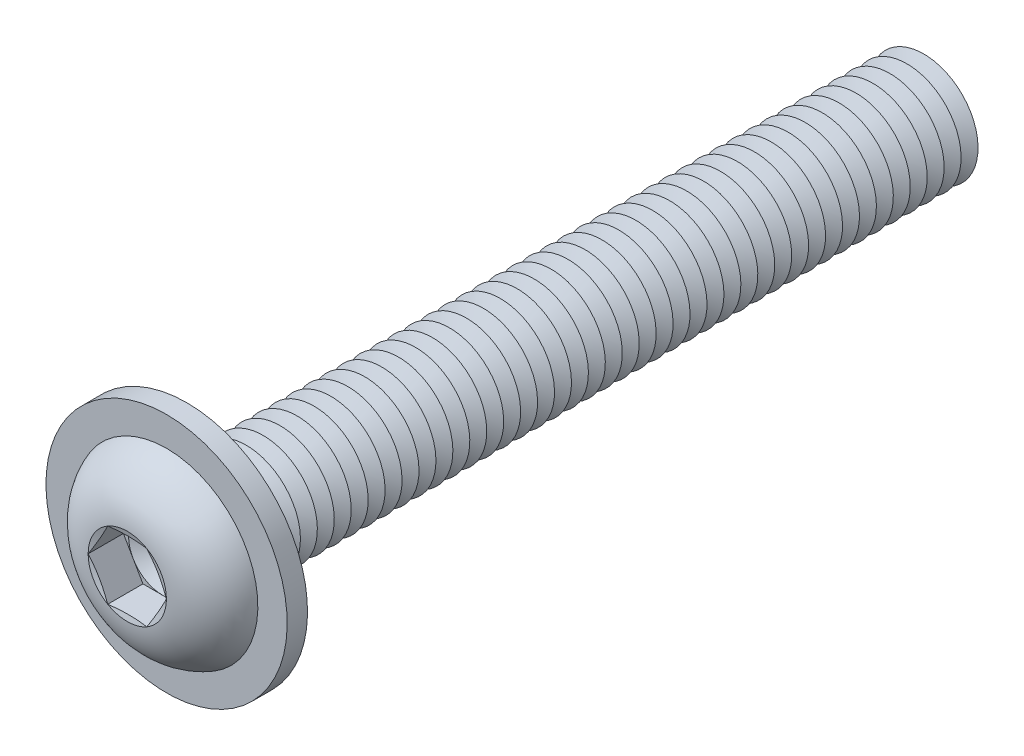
ISO-10303-21;
HEADER;
FILE_DESCRIPTION(('STEP AP214'),'2;1');
FILE_NAME('part.step','',(''),(''),'','','');
FILE_SCHEMA(('AUTOMOTIVE_DESIGN { 1 0 10303 214 1 1 1 1 }'));
ENDSEC;
DATA;
#1=APPLICATION_CONTEXT('core data for automotive mechanical design processes');
#2=APPLICATION_PROTOCOL_DEFINITION('international standard','automotive_design',2000,#1);
#3=PRODUCT_CONTEXT('',#1,'mechanical');
#4=PRODUCT('Part','Part','',(#3));
#5=PRODUCT_RELATED_PRODUCT_CATEGORY('part','',(#4));
#6=PRODUCT_DEFINITION_FORMATION('','',#4);
#7=PRODUCT_DEFINITION_CONTEXT('part definition',#1,'design');
#8=PRODUCT_DEFINITION('design','',#6,#7);
#9=PRODUCT_DEFINITION_SHAPE('','',#8);
#10=(LENGTH_UNIT() NAMED_UNIT(*) SI_UNIT(.MILLI.,.METRE.));
#11=(NAMED_UNIT(*) PLANE_ANGLE_UNIT() SI_UNIT($,.RADIAN.));
#12=(NAMED_UNIT(*) SI_UNIT($,.STERADIAN.) SOLID_ANGLE_UNIT());
#13=UNCERTAINTY_MEASURE_WITH_UNIT(LENGTH_MEASURE(1.E-05),#10,'distance_accuracy_value','');
#14=(GEOMETRIC_REPRESENTATION_CONTEXT(3) GLOBAL_UNCERTAINTY_ASSIGNED_CONTEXT((#13)) GLOBAL_UNIT_ASSIGNED_CONTEXT((#10,
#11,#12)) REPRESENTATION_CONTEXT('',''));
#15=CARTESIAN_POINT('',(0.,0.,0.));
#16=DIRECTION('',(0.,0.,1.));
#17=DIRECTION('',(1.,0.,0.));
#18=AXIS2_PLACEMENT_3D('',#15,#16,#17);
#19=CARTESIAN_POINT('',(0.,0.,-50.625));
#20=DIRECTION('',(0.,0.,1.));
#21=DIRECTION('',(0.,-1.,0.));
#22=AXIS2_PLACEMENT_3D('',#19,#20,#21);
#23=CONICAL_SURFACE('',#22,3.99999999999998,1.0471975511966);
#24=CARTESIAN_POINT('',(0.,0.,-51.25));
#25=DIRECTION('',(0.,0.,1.));
#26=DIRECTION('',(0.,-1.,0.));
#27=AXIS2_PLACEMENT_3D('',#24,#25,#26);
#28=CIRCLE('',#27,2.91746824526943);
#29=CARTESIAN_POINT('',(0.,-2.91746824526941,-51.25));
#30=VERTEX_POINT('',#29);
#31=EDGE_CURVE('E561',#30,#30,#28,.T.);
#32=ORIENTED_EDGE('',*,*,#31,.T.);
#33=EDGE_LOOP('',(#32));
#34=FACE_BOUND('',#33,.T.);
#35=CARTESIAN_POINT('',(0.,0.,-50.625));
#36=DIRECTION('',(0.,0.,1.));
#37=DIRECTION('',(0.,-1.,0.));
#38=AXIS2_PLACEMENT_3D('',#35,#36,#37);
#39=CIRCLE('',#38,3.99999999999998);
#40=CARTESIAN_POINT('',(0.,-3.99999999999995,-50.625));
#41=VERTEX_POINT('',#40);
#42=EDGE_CURVE('E557',#41,#41,#39,.T.);
#43=ORIENTED_EDGE('',*,*,#42,.F.);
#44=EDGE_LOOP('',(#43));
#45=FACE_BOUND('',#44,.T.);
#46=ADVANCED_FACE('F39',(#34,#45),#23,.T.);
#47=CARTESIAN_POINT('',(0.,0.,-51.25));
#48=DIRECTION('',(0.,0.,-1.));
#49=DIRECTION('',(0.,1.,0.));
#50=AXIS2_PLACEMENT_3D('',#47,#48,#49);
#51=CONICAL_SURFACE('',#50,2.91746824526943,1.0471975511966);
#52=CARTESIAN_POINT('',(0.,0.,-51.875));
#53=DIRECTION('',(0.,0.,1.));
#54=DIRECTION('',(0.,-1.,0.));
#55=AXIS2_PLACEMENT_3D('',#52,#53,#54);
#56=CIRCLE('',#55,3.99999999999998);
#57=CARTESIAN_POINT('',(0.,-3.99999999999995,-51.875));
#58=VERTEX_POINT('',#57);
#59=EDGE_CURVE('E565',#58,#58,#56,.T.);
#60=ORIENTED_EDGE('',*,*,#59,.T.);
#61=EDGE_LOOP('',(#60));
#62=FACE_BOUND('',#61,.T.);
#63=ORIENTED_EDGE('',*,*,#31,.F.);
#64=EDGE_LOOP('',(#63));
#65=FACE_BOUND('',#64,.T.);
#66=ADVANCED_FACE('F681',(#62,#65),#51,.T.);
#67=CARTESIAN_POINT('',(0.,3.99999999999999,-55.));
#68=DIRECTION('',(0.,0.,-1.));
#69=DIRECTION('',(0.,1.,0.));
#70=AXIS2_PLACEMENT_3D('',#67,#68,#69);
#71=PLANE('',#70);
#72=CARTESIAN_POINT('',(0.,0.,-55.));
#73=DIRECTION('',(0.,0.,1.));
#74=DIRECTION('',(0.,-1.,0.));
#75=AXIS2_PLACEMENT_3D('',#72,#73,#74);
#76=CIRCLE('',#75,2.91746824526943);
#77=CARTESIAN_POINT('',(0.,-2.9174682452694,-55.));
#78=VERTEX_POINT('',#77);
#79=EDGE_CURVE('E585',#78,#78,#76,.T.);
#80=ORIENTED_EDGE('',*,*,#79,.F.);
#81=EDGE_LOOP('',(#80));
#82=FACE_BOUND('',#81,.T.);
#83=ADVANCED_FACE('F687',(#82),#71,.T.);
#84=CARTESIAN_POINT('',(0.,0.,-54.375));
#85=DIRECTION('',(0.,0.,1.));
#86=DIRECTION('',(0.,-1.,0.));
#87=AXIS2_PLACEMENT_3D('',#84,#85,#86);
#88=CONICAL_SURFACE('',#87,3.99999999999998,1.0471975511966);
#89=ORIENTED_EDGE('',*,*,#79,.T.);
#90=EDGE_LOOP('',(#89));
#91=FACE_BOUND('',#90,.T.);
#92=CARTESIAN_POINT('',(0.,0.,-54.375));
#93=DIRECTION('',(0.,0.,1.));
#94=DIRECTION('',(0.,-1.,0.));
#95=AXIS2_PLACEMENT_3D('',#92,#93,#94);
#96=CIRCLE('',#95,3.99999999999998);
#97=CARTESIAN_POINT('',(0.,-3.99999999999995,-54.375));
#98=VERTEX_POINT('',#97);
#99=EDGE_CURVE('E581',#98,#98,#96,.T.);
#100=ORIENTED_EDGE('',*,*,#99,.F.);
#101=EDGE_LOOP('',(#100));
#102=FACE_BOUND('',#101,.T.);
#103=ADVANCED_FACE('F706',(#91,#102),#88,.T.);
#104=CARTESIAN_POINT('',(0.,0.,-53.75));
#105=DIRECTION('',(0.,0.,-1.));
#106=DIRECTION('',(0.,1.,0.));
#107=AXIS2_PLACEMENT_3D('',#104,#105,#106);
#108=CONICAL_SURFACE('',#107,2.91746824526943,1.0471975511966);
#109=ORIENTED_EDGE('',*,*,#99,.T.);
#110=EDGE_LOOP('',(#109));
#111=FACE_BOUND('',#110,.T.);
#112=CARTESIAN_POINT('',(0.,0.,-53.75));
#113=DIRECTION('',(0.,0.,1.));
#114=DIRECTION('',(0.,-1.,0.));
#115=AXIS2_PLACEMENT_3D('',#112,#113,#114);
#116=CIRCLE('',#115,2.91746824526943);
#117=CARTESIAN_POINT('',(0.,-2.9174682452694,-53.75));
#118=VERTEX_POINT('',#117);
#119=EDGE_CURVE('E577',#118,#118,#116,.T.);
#120=ORIENTED_EDGE('',*,*,#119,.F.);
#121=EDGE_LOOP('',(#120));
#122=FACE_BOUND('',#121,.T.);
#123=ADVANCED_FACE('F703',(#111,#122),#108,.T.);
#124=CARTESIAN_POINT('',(0.,0.,-53.125));
#125=DIRECTION('',(0.,0.,1.));
#126=DIRECTION('',(0.,-1.,0.));
#127=AXIS2_PLACEMENT_3D('',#124,#125,#126);
#128=CONICAL_SURFACE('',#127,3.99999999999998,1.0471975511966);
#129=ORIENTED_EDGE('',*,*,#119,.T.);
#130=EDGE_LOOP('',(#129));
#131=FACE_BOUND('',#130,.T.);
#132=CARTESIAN_POINT('',(0.,0.,-53.125));
#133=DIRECTION('',(0.,0.,1.));
#134=DIRECTION('',(0.,-1.,0.));
#135=AXIS2_PLACEMENT_3D('',#132,#133,#134);
#136=CIRCLE('',#135,3.99999999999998);
#137=CARTESIAN_POINT('',(0.,-3.99999999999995,-53.125));
#138=VERTEX_POINT('',#137);
#139=EDGE_CURVE('E573',#138,#138,#136,.T.);
#140=ORIENTED_EDGE('',*,*,#139,.F.);
#141=EDGE_LOOP('',(#140));
#142=FACE_BOUND('',#141,.T.);
#143=ADVANCED_FACE('F697',(#131,#142),#128,.T.);
#144=CARTESIAN_POINT('',(0.,0.,-52.5));
#145=DIRECTION('',(0.,0.,-1.));
#146=DIRECTION('',(0.,1.,0.));
#147=AXIS2_PLACEMENT_3D('',#144,#145,#146);
#148=CONICAL_SURFACE('',#147,2.91746824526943,1.0471975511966);
#149=ORIENTED_EDGE('',*,*,#139,.T.);
#150=EDGE_LOOP('',(#149));
#151=FACE_BOUND('',#150,.T.);
#152=CARTESIAN_POINT('',(0.,0.,-52.5));
#153=DIRECTION('',(0.,0.,1.));
#154=DIRECTION('',(0.,-1.,0.));
#155=AXIS2_PLACEMENT_3D('',#152,#153,#154);
#156=CIRCLE('',#155,2.91746824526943);
#157=CARTESIAN_POINT('',(0.,-2.9174682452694,-52.5));
#158=VERTEX_POINT('',#157);
#159=EDGE_CURVE('E569',#158,#158,#156,.T.);
#160=ORIENTED_EDGE('',*,*,#159,.F.);
#161=EDGE_LOOP('',(#160));
#162=FACE_BOUND('',#161,.T.);
#163=ADVANCED_FACE('F693',(#151,#162),#148,.T.);
#164=CARTESIAN_POINT('',(0.,0.,-51.875));
#165=DIRECTION('',(0.,0.,1.));
#166=DIRECTION('',(0.,-1.,0.));
#167=AXIS2_PLACEMENT_3D('',#164,#165,#166);
#168=CONICAL_SURFACE('',#167,3.99999999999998,1.0471975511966);
#169=ORIENTED_EDGE('',*,*,#159,.T.);
#170=EDGE_LOOP('',(#169));
#171=FACE_BOUND('',#170,.T.);
#172=ORIENTED_EDGE('',*,*,#59,.F.);
#173=EDGE_LOOP('',(#172));
#174=FACE_BOUND('',#173,.T.);
#175=ADVANCED_FACE('F696',(#171,#174),#168,.T.);
#176=CARTESIAN_POINT('',(0.,0.,-49.375));
#177=DIRECTION('',(0.,0.,1.));
#178=DIRECTION('',(0.,-1.,0.));
#179=AXIS2_PLACEMENT_3D('',#176,#177,#178);
#180=CONICAL_SURFACE('',#179,3.99999999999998,1.0471975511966);
#181=CARTESIAN_POINT('',(0.,0.,-50.));
#182=DIRECTION('',(0.,0.,1.));
#183=DIRECTION('',(0.,-1.,0.));
#184=AXIS2_PLACEMENT_3D('',#181,#182,#183);
#185=CIRCLE('',#184,2.91746824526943);
#186=CARTESIAN_POINT('',(0.,-2.91746824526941,-50.));
#187=VERTEX_POINT('',#186);
#188=EDGE_CURVE('E553',#187,#187,#185,.T.);
#189=ORIENTED_EDGE('',*,*,#188,.T.);
#190=EDGE_LOOP('',(#189));
#191=FACE_BOUND('',#190,.T.);
#192=CARTESIAN_POINT('',(0.,0.,-49.375));
#193=DIRECTION('',(0.,0.,1.));
#194=DIRECTION('',(0.,-1.,0.));
#195=AXIS2_PLACEMENT_3D('',#192,#193,#194);
#196=CIRCLE('',#195,3.99999999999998);
#197=CARTESIAN_POINT('',(0.,-3.99999999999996,-49.375));
#198=VERTEX_POINT('',#197);
#199=EDGE_CURVE('E549',#198,#198,#196,.T.);
#200=ORIENTED_EDGE('',*,*,#199,.F.);
#201=EDGE_LOOP('',(#200));
#202=FACE_BOUND('',#201,.T.);
#203=ADVANCED_FACE('F701',(#191,#202),#180,.T.);
#204=CARTESIAN_POINT('',(0.,0.,-50.));
#205=DIRECTION('',(0.,0.,-1.));
#206=DIRECTION('',(0.,1.,0.));
#207=AXIS2_PLACEMENT_3D('',#204,#205,#206);
#208=CONICAL_SURFACE('',#207,2.91746824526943,1.0471975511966);
#209=ORIENTED_EDGE('',*,*,#42,.T.);
#210=EDGE_LOOP('',(#209));
#211=FACE_BOUND('',#210,.T.);
#212=ORIENTED_EDGE('',*,*,#188,.F.);
#213=EDGE_LOOP('',(#212));
#214=FACE_BOUND('',#213,.T.);
#215=ADVANCED_FACE('F752',(#211,#214),#208,.T.);
#216=CARTESIAN_POINT('',(0.,0.,-48.125));
#217=DIRECTION('',(0.,0.,1.));
#218=DIRECTION('',(0.,-1.,0.));
#219=AXIS2_PLACEMENT_3D('',#216,#217,#218);
#220=CONICAL_SURFACE('',#219,3.99999999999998,1.0471975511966);
#221=CARTESIAN_POINT('',(0.,0.,-48.75));
#222=DIRECTION('',(0.,0.,1.));
#223=DIRECTION('',(0.,-1.,0.));
#224=AXIS2_PLACEMENT_3D('',#221,#222,#223);
#225=CIRCLE('',#224,2.91746824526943);
#226=CARTESIAN_POINT('',(0.,-2.91746824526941,-48.75));
#227=VERTEX_POINT('',#226);
#228=EDGE_CURVE('E545',#227,#227,#225,.T.);
#229=ORIENTED_EDGE('',*,*,#228,.T.);
#230=EDGE_LOOP('',(#229));
#231=FACE_BOUND('',#230,.T.);
#232=CARTESIAN_POINT('',(0.,0.,-48.125));
#233=DIRECTION('',(0.,0.,1.));
#234=DIRECTION('',(0.,-1.,0.));
#235=AXIS2_PLACEMENT_3D('',#232,#233,#234);
#236=CIRCLE('',#235,3.99999999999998);
#237=CARTESIAN_POINT('',(0.,-3.99999999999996,-48.125));
#238=VERTEX_POINT('',#237);
#239=EDGE_CURVE('E541',#238,#238,#236,.T.);
#240=ORIENTED_EDGE('',*,*,#239,.F.);
#241=EDGE_LOOP('',(#240));
#242=FACE_BOUND('',#241,.T.);
#243=ADVANCED_FACE('F758',(#231,#242),#220,.T.);
#244=CARTESIAN_POINT('',(0.,0.,-48.75));
#245=DIRECTION('',(0.,0.,-1.));
#246=DIRECTION('',(0.,1.,0.));
#247=AXIS2_PLACEMENT_3D('',#244,#245,#246);
#248=CONICAL_SURFACE('',#247,2.91746824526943,1.0471975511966);
#249=ORIENTED_EDGE('',*,*,#199,.T.);
#250=EDGE_LOOP('',(#249));
#251=FACE_BOUND('',#250,.T.);
#252=ORIENTED_EDGE('',*,*,#228,.F.);
#253=EDGE_LOOP('',(#252));
#254=FACE_BOUND('',#253,.T.);
#255=ADVANCED_FACE('F765',(#251,#254),#248,.T.);
#256=CARTESIAN_POINT('',(0.,0.,-46.875));
#257=DIRECTION('',(0.,0.,1.));
#258=DIRECTION('',(0.,-1.,0.));
#259=AXIS2_PLACEMENT_3D('',#256,#257,#258);
#260=CONICAL_SURFACE('',#259,3.99999999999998,1.0471975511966);
#261=CARTESIAN_POINT('',(0.,0.,-47.5));
#262=DIRECTION('',(0.,0.,1.));
#263=DIRECTION('',(0.,-1.,0.));
#264=AXIS2_PLACEMENT_3D('',#261,#262,#263);
#265=CIRCLE('',#264,2.91746824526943);
#266=CARTESIAN_POINT('',(0.,-2.91746824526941,-47.5));
#267=VERTEX_POINT('',#266);
#268=EDGE_CURVE('E537',#267,#267,#265,.T.);
#269=ORIENTED_EDGE('',*,*,#268,.T.);
#270=EDGE_LOOP('',(#269));
#271=FACE_BOUND('',#270,.T.);
#272=CARTESIAN_POINT('',(0.,0.,-46.875));
#273=DIRECTION('',(0.,0.,1.));
#274=DIRECTION('',(0.,-1.,0.));
#275=AXIS2_PLACEMENT_3D('',#272,#273,#274);
#276=CIRCLE('',#275,3.99999999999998);
#277=CARTESIAN_POINT('',(0.,-3.99999999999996,-46.875));
#278=VERTEX_POINT('',#277);
#279=EDGE_CURVE('E533',#278,#278,#276,.T.);
#280=ORIENTED_EDGE('',*,*,#279,.F.);
#281=EDGE_LOOP('',(#280));
#282=FACE_BOUND('',#281,.T.);
#283=ADVANCED_FACE('F772',(#271,#282),#260,.T.);
#284=CARTESIAN_POINT('',(0.,0.,-47.5));
#285=DIRECTION('',(0.,0.,-1.));
#286=DIRECTION('',(0.,1.,0.));
#287=AXIS2_PLACEMENT_3D('',#284,#285,#286);
#288=CONICAL_SURFACE('',#287,2.91746824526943,1.0471975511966);
#289=ORIENTED_EDGE('',*,*,#239,.T.);
#290=EDGE_LOOP('',(#289));
#291=FACE_BOUND('',#290,.T.);
#292=ORIENTED_EDGE('',*,*,#268,.F.);
#293=EDGE_LOOP('',(#292));
#294=FACE_BOUND('',#293,.T.);
#295=ADVANCED_FACE('F779',(#291,#294),#288,.T.);
#296=CARTESIAN_POINT('',(0.,0.,-45.625));
#297=DIRECTION('',(0.,0.,1.));
#298=DIRECTION('',(0.,-1.,0.));
#299=AXIS2_PLACEMENT_3D('',#296,#297,#298);
#300=CONICAL_SURFACE('',#299,3.99999999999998,1.0471975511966);
#301=CARTESIAN_POINT('',(0.,0.,-46.25));
#302=DIRECTION('',(0.,0.,1.));
#303=DIRECTION('',(0.,-1.,0.));
#304=AXIS2_PLACEMENT_3D('',#301,#302,#303);
#305=CIRCLE('',#304,2.91746824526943);
#306=CARTESIAN_POINT('',(0.,-2.91746824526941,-46.25));
#307=VERTEX_POINT('',#306);
#308=EDGE_CURVE('E529',#307,#307,#305,.T.);
#309=ORIENTED_EDGE('',*,*,#308,.T.);
#310=EDGE_LOOP('',(#309));
#311=FACE_BOUND('',#310,.T.);
#312=CARTESIAN_POINT('',(0.,0.,-45.625));
#313=DIRECTION('',(0.,0.,1.));
#314=DIRECTION('',(0.,-1.,0.));
#315=AXIS2_PLACEMENT_3D('',#312,#313,#314);
#316=CIRCLE('',#315,3.99999999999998);
#317=CARTESIAN_POINT('',(0.,-3.99999999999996,-45.625));
#318=VERTEX_POINT('',#317);
#319=EDGE_CURVE('E525',#318,#318,#316,.T.);
#320=ORIENTED_EDGE('',*,*,#319,.F.);
#321=EDGE_LOOP('',(#320));
#322=FACE_BOUND('',#321,.T.);
#323=ADVANCED_FACE('F786',(#311,#322),#300,.T.);
#324=CARTESIAN_POINT('',(0.,0.,-46.25));
#325=DIRECTION('',(0.,0.,-1.));
#326=DIRECTION('',(0.,1.,0.));
#327=AXIS2_PLACEMENT_3D('',#324,#325,#326);
#328=CONICAL_SURFACE('',#327,2.91746824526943,1.0471975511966);
#329=ORIENTED_EDGE('',*,*,#279,.T.);
#330=EDGE_LOOP('',(#329));
#331=FACE_BOUND('',#330,.T.);
#332=ORIENTED_EDGE('',*,*,#308,.F.);
#333=EDGE_LOOP('',(#332));
#334=FACE_BOUND('',#333,.T.);
#335=ADVANCED_FACE('F793',(#331,#334),#328,.T.);
#336=CARTESIAN_POINT('',(0.,0.,-44.375));
#337=DIRECTION('',(0.,0.,1.));
#338=DIRECTION('',(0.,-1.,0.));
#339=AXIS2_PLACEMENT_3D('',#336,#337,#338);
#340=CONICAL_SURFACE('',#339,3.99999999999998,1.0471975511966);
#341=CARTESIAN_POINT('',(0.,0.,-45.));
#342=DIRECTION('',(0.,0.,1.));
#343=DIRECTION('',(0.,-1.,0.));
#344=AXIS2_PLACEMENT_3D('',#341,#342,#343);
#345=CIRCLE('',#344,2.91746824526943);
#346=CARTESIAN_POINT('',(0.,-2.91746824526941,-45.));
#347=VERTEX_POINT('',#346);
#348=EDGE_CURVE('E521',#347,#347,#345,.T.);
#349=ORIENTED_EDGE('',*,*,#348,.T.);
#350=EDGE_LOOP('',(#349));
#351=FACE_BOUND('',#350,.T.);
#352=CARTESIAN_POINT('',(0.,0.,-44.375));
#353=DIRECTION('',(0.,0.,1.));
#354=DIRECTION('',(0.,-1.,0.));
#355=AXIS2_PLACEMENT_3D('',#352,#353,#354);
#356=CIRCLE('',#355,3.99999999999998);
#357=CARTESIAN_POINT('',(0.,-3.99999999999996,-44.375));
#358=VERTEX_POINT('',#357);
#359=EDGE_CURVE('E517',#358,#358,#356,.T.);
#360=ORIENTED_EDGE('',*,*,#359,.F.);
#361=EDGE_LOOP('',(#360));
#362=FACE_BOUND('',#361,.T.);
#363=ADVANCED_FACE('F800',(#351,#362),#340,.T.);
#364=CARTESIAN_POINT('',(0.,0.,-45.));
#365=DIRECTION('',(0.,0.,-1.));
#366=DIRECTION('',(0.,1.,0.));
#367=AXIS2_PLACEMENT_3D('',#364,#365,#366);
#368=CONICAL_SURFACE('',#367,2.91746824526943,1.0471975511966);
#369=ORIENTED_EDGE('',*,*,#319,.T.);
#370=EDGE_LOOP('',(#369));
#371=FACE_BOUND('',#370,.T.);
#372=ORIENTED_EDGE('',*,*,#348,.F.);
#373=EDGE_LOOP('',(#372));
#374=FACE_BOUND('',#373,.T.);
#375=ADVANCED_FACE('F807',(#371,#374),#368,.T.);
#376=CARTESIAN_POINT('',(0.,0.,-43.125));
#377=DIRECTION('',(0.,0.,1.));
#378=DIRECTION('',(0.,-1.,0.));
#379=AXIS2_PLACEMENT_3D('',#376,#377,#378);
#380=CONICAL_SURFACE('',#379,3.99999999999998,1.0471975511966);
#381=CARTESIAN_POINT('',(0.,0.,-43.75));
#382=DIRECTION('',(0.,0.,1.));
#383=DIRECTION('',(0.,-1.,0.));
#384=AXIS2_PLACEMENT_3D('',#381,#382,#383);
#385=CIRCLE('',#384,2.91746824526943);
#386=CARTESIAN_POINT('',(0.,-2.91746824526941,-43.75));
#387=VERTEX_POINT('',#386);
#388=EDGE_CURVE('E513',#387,#387,#385,.T.);
#389=ORIENTED_EDGE('',*,*,#388,.T.);
#390=EDGE_LOOP('',(#389));
#391=FACE_BOUND('',#390,.T.);
#392=CARTESIAN_POINT('',(0.,0.,-43.125));
#393=DIRECTION('',(0.,0.,1.));
#394=DIRECTION('',(0.,-1.,0.));
#395=AXIS2_PLACEMENT_3D('',#392,#393,#394);
#396=CIRCLE('',#395,3.99999999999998);
#397=CARTESIAN_POINT('',(0.,-3.99999999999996,-43.125));
#398=VERTEX_POINT('',#397);
#399=EDGE_CURVE('E509',#398,#398,#396,.T.);
#400=ORIENTED_EDGE('',*,*,#399,.F.);
#401=EDGE_LOOP('',(#400));
#402=FACE_BOUND('',#401,.T.);
#403=ADVANCED_FACE('F814',(#391,#402),#380,.T.);
#404=CARTESIAN_POINT('',(0.,0.,-43.75));
#405=DIRECTION('',(0.,0.,-1.));
#406=DIRECTION('',(0.,1.,0.));
#407=AXIS2_PLACEMENT_3D('',#404,#405,#406);
#408=CONICAL_SURFACE('',#407,2.91746824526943,1.0471975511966);
#409=ORIENTED_EDGE('',*,*,#359,.T.);
#410=EDGE_LOOP('',(#409));
#411=FACE_BOUND('',#410,.T.);
#412=ORIENTED_EDGE('',*,*,#388,.F.);
#413=EDGE_LOOP('',(#412));
#414=FACE_BOUND('',#413,.T.);
#415=ADVANCED_FACE('F821',(#411,#414),#408,.T.);
#416=CARTESIAN_POINT('',(0.,0.,-41.875));
#417=DIRECTION('',(0.,0.,1.));
#418=DIRECTION('',(0.,-1.,0.));
#419=AXIS2_PLACEMENT_3D('',#416,#417,#418);
#420=CONICAL_SURFACE('',#419,3.99999999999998,1.0471975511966);
#421=CARTESIAN_POINT('',(0.,0.,-42.5));
#422=DIRECTION('',(0.,0.,1.));
#423=DIRECTION('',(0.,-1.,0.));
#424=AXIS2_PLACEMENT_3D('',#421,#422,#423);
#425=CIRCLE('',#424,2.91746824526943);
#426=CARTESIAN_POINT('',(0.,-2.91746824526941,-42.5));
#427=VERTEX_POINT('',#426);
#428=EDGE_CURVE('E505',#427,#427,#425,.T.);
#429=ORIENTED_EDGE('',*,*,#428,.T.);
#430=EDGE_LOOP('',(#429));
#431=FACE_BOUND('',#430,.T.);
#432=CARTESIAN_POINT('',(0.,0.,-41.875));
#433=DIRECTION('',(0.,0.,1.));
#434=DIRECTION('',(0.,-1.,0.));
#435=AXIS2_PLACEMENT_3D('',#432,#433,#434);
#436=CIRCLE('',#435,3.99999999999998);
#437=CARTESIAN_POINT('',(0.,-3.99999999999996,-41.875));
#438=VERTEX_POINT('',#437);
#439=EDGE_CURVE('E501',#438,#438,#436,.T.);
#440=ORIENTED_EDGE('',*,*,#439,.F.);
#441=EDGE_LOOP('',(#440));
#442=FACE_BOUND('',#441,.T.);
#443=ADVANCED_FACE('F828',(#431,#442),#420,.T.);
#444=CARTESIAN_POINT('',(0.,0.,-42.5));
#445=DIRECTION('',(0.,0.,-1.));
#446=DIRECTION('',(0.,1.,0.));
#447=AXIS2_PLACEMENT_3D('',#444,#445,#446);
#448=CONICAL_SURFACE('',#447,2.91746824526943,1.0471975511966);
#449=ORIENTED_EDGE('',*,*,#399,.T.);
#450=EDGE_LOOP('',(#449));
#451=FACE_BOUND('',#450,.T.);
#452=ORIENTED_EDGE('',*,*,#428,.F.);
#453=EDGE_LOOP('',(#452));
#454=FACE_BOUND('',#453,.T.);
#455=ADVANCED_FACE('F835',(#451,#454),#448,.T.);
#456=CARTESIAN_POINT('',(0.,0.,-40.625));
#457=DIRECTION('',(0.,0.,1.));
#458=DIRECTION('',(0.,-1.,0.));
#459=AXIS2_PLACEMENT_3D('',#456,#457,#458);
#460=CONICAL_SURFACE('',#459,3.99999999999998,1.0471975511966);
#461=CARTESIAN_POINT('',(0.,0.,-41.25));
#462=DIRECTION('',(0.,0.,1.));
#463=DIRECTION('',(0.,-1.,0.));
#464=AXIS2_PLACEMENT_3D('',#461,#462,#463);
#465=CIRCLE('',#464,2.91746824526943);
#466=CARTESIAN_POINT('',(0.,-2.91746824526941,-41.25));
#467=VERTEX_POINT('',#466);
#468=EDGE_CURVE('E497',#467,#467,#465,.T.);
#469=ORIENTED_EDGE('',*,*,#468,.T.);
#470=EDGE_LOOP('',(#469));
#471=FACE_BOUND('',#470,.T.);
#472=CARTESIAN_POINT('',(0.,0.,-40.625));
#473=DIRECTION('',(0.,0.,1.));
#474=DIRECTION('',(0.,-1.,0.));
#475=AXIS2_PLACEMENT_3D('',#472,#473,#474);
#476=CIRCLE('',#475,3.99999999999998);
#477=CARTESIAN_POINT('',(0.,-3.99999999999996,-40.625));
#478=VERTEX_POINT('',#477);
#479=EDGE_CURVE('E493',#478,#478,#476,.T.);
#480=ORIENTED_EDGE('',*,*,#479,.F.);
#481=EDGE_LOOP('',(#480));
#482=FACE_BOUND('',#481,.T.);
#483=ADVANCED_FACE('F842',(#471,#482),#460,.T.);
#484=CARTESIAN_POINT('',(0.,0.,-41.25));
#485=DIRECTION('',(0.,0.,-1.));
#486=DIRECTION('',(0.,1.,0.));
#487=AXIS2_PLACEMENT_3D('',#484,#485,#486);
#488=CONICAL_SURFACE('',#487,2.91746824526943,1.0471975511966);
#489=ORIENTED_EDGE('',*,*,#439,.T.);
#490=EDGE_LOOP('',(#489));
#491=FACE_BOUND('',#490,.T.);
#492=ORIENTED_EDGE('',*,*,#468,.F.);
#493=EDGE_LOOP('',(#492));
#494=FACE_BOUND('',#493,.T.);
#495=ADVANCED_FACE('F849',(#491,#494),#488,.T.);
#496=CARTESIAN_POINT('',(0.,0.,-39.375));
#497=DIRECTION('',(0.,0.,1.));
#498=DIRECTION('',(0.,-1.,0.));
#499=AXIS2_PLACEMENT_3D('',#496,#497,#498);
#500=CONICAL_SURFACE('',#499,3.99999999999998,1.0471975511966);
#501=CARTESIAN_POINT('',(0.,0.,-40.));
#502=DIRECTION('',(0.,0.,1.));
#503=DIRECTION('',(0.,-1.,0.));
#504=AXIS2_PLACEMENT_3D('',#501,#502,#503);
#505=CIRCLE('',#504,2.91746824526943);
#506=CARTESIAN_POINT('',(0.,-2.91746824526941,-40.));
#507=VERTEX_POINT('',#506);
#508=EDGE_CURVE('E489',#507,#507,#505,.T.);
#509=ORIENTED_EDGE('',*,*,#508,.T.);
#510=EDGE_LOOP('',(#509));
#511=FACE_BOUND('',#510,.T.);
#512=CARTESIAN_POINT('',(0.,0.,-39.375));
#513=DIRECTION('',(0.,0.,1.));
#514=DIRECTION('',(0.,-1.,0.));
#515=AXIS2_PLACEMENT_3D('',#512,#513,#514);
#516=CIRCLE('',#515,3.99999999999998);
#517=CARTESIAN_POINT('',(0.,-3.99999999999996,-39.375));
#518=VERTEX_POINT('',#517);
#519=EDGE_CURVE('E485',#518,#518,#516,.T.);
#520=ORIENTED_EDGE('',*,*,#519,.F.);
#521=EDGE_LOOP('',(#520));
#522=FACE_BOUND('',#521,.T.);
#523=ADVANCED_FACE('F856',(#511,#522),#500,.T.);
#524=CARTESIAN_POINT('',(0.,0.,-40.));
#525=DIRECTION('',(0.,0.,-1.));
#526=DIRECTION('',(0.,1.,0.));
#527=AXIS2_PLACEMENT_3D('',#524,#525,#526);
#528=CONICAL_SURFACE('',#527,2.91746824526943,1.0471975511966);
#529=ORIENTED_EDGE('',*,*,#479,.T.);
#530=EDGE_LOOP('',(#529));
#531=FACE_BOUND('',#530,.T.);
#532=ORIENTED_EDGE('',*,*,#508,.F.);
#533=EDGE_LOOP('',(#532));
#534=FACE_BOUND('',#533,.T.);
#535=ADVANCED_FACE('F863',(#531,#534),#528,.T.);
#536=CARTESIAN_POINT('',(0.,0.,-38.125));
#537=DIRECTION('',(0.,0.,1.));
#538=DIRECTION('',(0.,-1.,0.));
#539=AXIS2_PLACEMENT_3D('',#536,#537,#538);
#540=CONICAL_SURFACE('',#539,3.99999999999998,1.0471975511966);
#541=CARTESIAN_POINT('',(0.,0.,-38.75));
#542=DIRECTION('',(0.,0.,1.));
#543=DIRECTION('',(0.,-1.,0.));
#544=AXIS2_PLACEMENT_3D('',#541,#542,#543);
#545=CIRCLE('',#544,2.91746824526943);
#546=CARTESIAN_POINT('',(0.,-2.91746824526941,-38.75));
#547=VERTEX_POINT('',#546);
#548=EDGE_CURVE('E481',#547,#547,#545,.T.);
#549=ORIENTED_EDGE('',*,*,#548,.T.);
#550=EDGE_LOOP('',(#549));
#551=FACE_BOUND('',#550,.T.);
#552=CARTESIAN_POINT('',(0.,0.,-38.125));
#553=DIRECTION('',(0.,0.,1.));
#554=DIRECTION('',(0.,-1.,0.));
#555=AXIS2_PLACEMENT_3D('',#552,#553,#554);
#556=CIRCLE('',#555,3.99999999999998);
#557=CARTESIAN_POINT('',(0.,-3.99999999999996,-38.125));
#558=VERTEX_POINT('',#557);
#559=EDGE_CURVE('E477',#558,#558,#556,.T.);
#560=ORIENTED_EDGE('',*,*,#559,.F.);
#561=EDGE_LOOP('',(#560));
#562=FACE_BOUND('',#561,.T.);
#563=ADVANCED_FACE('F870',(#551,#562),#540,.T.);
#564=CARTESIAN_POINT('',(0.,0.,-38.75));
#565=DIRECTION('',(0.,0.,-1.));
#566=DIRECTION('',(0.,1.,0.));
#567=AXIS2_PLACEMENT_3D('',#564,#565,#566);
#568=CONICAL_SURFACE('',#567,2.91746824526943,1.0471975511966);
#569=ORIENTED_EDGE('',*,*,#519,.T.);
#570=EDGE_LOOP('',(#569));
#571=FACE_BOUND('',#570,.T.);
#572=ORIENTED_EDGE('',*,*,#548,.F.);
#573=EDGE_LOOP('',(#572));
#574=FACE_BOUND('',#573,.T.);
#575=ADVANCED_FACE('F877',(#571,#574),#568,.T.);
#576=CARTESIAN_POINT('',(0.,0.,-36.875));
#577=DIRECTION('',(0.,0.,1.));
#578=DIRECTION('',(0.,-1.,0.));
#579=AXIS2_PLACEMENT_3D('',#576,#577,#578);
#580=CONICAL_SURFACE('',#579,3.99999999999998,1.0471975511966);
#581=CARTESIAN_POINT('',(0.,0.,-37.5));
#582=DIRECTION('',(0.,0.,1.));
#583=DIRECTION('',(0.,-1.,0.));
#584=AXIS2_PLACEMENT_3D('',#581,#582,#583);
#585=CIRCLE('',#584,2.91746824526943);
#586=CARTESIAN_POINT('',(0.,-2.91746824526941,-37.5));
#587=VERTEX_POINT('',#586);
#588=EDGE_CURVE('E473',#587,#587,#585,.T.);
#589=ORIENTED_EDGE('',*,*,#588,.T.);
#590=EDGE_LOOP('',(#589));
#591=FACE_BOUND('',#590,.T.);
#592=CARTESIAN_POINT('',(0.,0.,-36.875));
#593=DIRECTION('',(0.,0.,1.));
#594=DIRECTION('',(0.,-1.,0.));
#595=AXIS2_PLACEMENT_3D('',#592,#593,#594);
#596=CIRCLE('',#595,3.99999999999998);
#597=CARTESIAN_POINT('',(0.,-3.99999999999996,-36.875));
#598=VERTEX_POINT('',#597);
#599=EDGE_CURVE('E469',#598,#598,#596,.T.);
#600=ORIENTED_EDGE('',*,*,#599,.F.);
#601=EDGE_LOOP('',(#600));
#602=FACE_BOUND('',#601,.T.);
#603=ADVANCED_FACE('F884',(#591,#602),#580,.T.);
#604=CARTESIAN_POINT('',(0.,0.,-37.5));
#605=DIRECTION('',(0.,0.,-1.));
#606=DIRECTION('',(0.,1.,0.));
#607=AXIS2_PLACEMENT_3D('',#604,#605,#606);
#608=CONICAL_SURFACE('',#607,2.91746824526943,1.0471975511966);
#609=ORIENTED_EDGE('',*,*,#559,.T.);
#610=EDGE_LOOP('',(#609));
#611=FACE_BOUND('',#610,.T.);
#612=ORIENTED_EDGE('',*,*,#588,.F.);
#613=EDGE_LOOP('',(#612));
#614=FACE_BOUND('',#613,.T.);
#615=ADVANCED_FACE('F891',(#611,#614),#608,.T.);
#616=CARTESIAN_POINT('',(0.,0.,-35.625));
#617=DIRECTION('',(0.,0.,1.));
#618=DIRECTION('',(0.,-1.,0.));
#619=AXIS2_PLACEMENT_3D('',#616,#617,#618);
#620=CONICAL_SURFACE('',#619,3.99999999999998,1.0471975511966);
#621=CARTESIAN_POINT('',(0.,0.,-36.25));
#622=DIRECTION('',(0.,0.,1.));
#623=DIRECTION('',(0.,-1.,0.));
#624=AXIS2_PLACEMENT_3D('',#621,#622,#623);
#625=CIRCLE('',#624,2.91746824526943);
#626=CARTESIAN_POINT('',(0.,-2.91746824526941,-36.25));
#627=VERTEX_POINT('',#626);
#628=EDGE_CURVE('E465',#627,#627,#625,.T.);
#629=ORIENTED_EDGE('',*,*,#628,.T.);
#630=EDGE_LOOP('',(#629));
#631=FACE_BOUND('',#630,.T.);
#632=CARTESIAN_POINT('',(0.,0.,-35.625));
#633=DIRECTION('',(0.,0.,1.));
#634=DIRECTION('',(0.,-1.,0.));
#635=AXIS2_PLACEMENT_3D('',#632,#633,#634);
#636=CIRCLE('',#635,3.99999999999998);
#637=CARTESIAN_POINT('',(0.,-3.99999999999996,-35.625));
#638=VERTEX_POINT('',#637);
#639=EDGE_CURVE('E461',#638,#638,#636,.T.);
#640=ORIENTED_EDGE('',*,*,#639,.F.);
#641=EDGE_LOOP('',(#640));
#642=FACE_BOUND('',#641,.T.);
#643=ADVANCED_FACE('F898',(#631,#642),#620,.T.);
#644=CARTESIAN_POINT('',(0.,0.,-36.25));
#645=DIRECTION('',(0.,0.,-1.));
#646=DIRECTION('',(0.,1.,0.));
#647=AXIS2_PLACEMENT_3D('',#644,#645,#646);
#648=CONICAL_SURFACE('',#647,2.91746824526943,1.0471975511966);
#649=ORIENTED_EDGE('',*,*,#599,.T.);
#650=EDGE_LOOP('',(#649));
#651=FACE_BOUND('',#650,.T.);
#652=ORIENTED_EDGE('',*,*,#628,.F.);
#653=EDGE_LOOP('',(#652));
#654=FACE_BOUND('',#653,.T.);
#655=ADVANCED_FACE('F905',(#651,#654),#648,.T.);
#656=CARTESIAN_POINT('',(0.,0.,-34.375));
#657=DIRECTION('',(0.,0.,1.));
#658=DIRECTION('',(0.,-1.,0.));
#659=AXIS2_PLACEMENT_3D('',#656,#657,#658);
#660=CONICAL_SURFACE('',#659,3.99999999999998,1.0471975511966);
#661=CARTESIAN_POINT('',(0.,0.,-35.));
#662=DIRECTION('',(0.,0.,1.));
#663=DIRECTION('',(0.,-1.,0.));
#664=AXIS2_PLACEMENT_3D('',#661,#662,#663);
#665=CIRCLE('',#664,2.91746824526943);
#666=CARTESIAN_POINT('',(0.,-2.91746824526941,-35.));
#667=VERTEX_POINT('',#666);
#668=EDGE_CURVE('E457',#667,#667,#665,.T.);
#669=ORIENTED_EDGE('',*,*,#668,.T.);
#670=EDGE_LOOP('',(#669));
#671=FACE_BOUND('',#670,.T.);
#672=CARTESIAN_POINT('',(0.,0.,-34.375));
#673=DIRECTION('',(0.,0.,1.));
#674=DIRECTION('',(0.,-1.,0.));
#675=AXIS2_PLACEMENT_3D('',#672,#673,#674);
#676=CIRCLE('',#675,3.99999999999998);
#677=CARTESIAN_POINT('',(0.,-3.99999999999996,-34.375));
#678=VERTEX_POINT('',#677);
#679=EDGE_CURVE('E453',#678,#678,#676,.T.);
#680=ORIENTED_EDGE('',*,*,#679,.F.);
#681=EDGE_LOOP('',(#680));
#682=FACE_BOUND('',#681,.T.);
#683=ADVANCED_FACE('F912',(#671,#682),#660,.T.);
#684=CARTESIAN_POINT('',(0.,0.,-35.));
#685=DIRECTION('',(0.,0.,-1.));
#686=DIRECTION('',(0.,1.,0.));
#687=AXIS2_PLACEMENT_3D('',#684,#685,#686);
#688=CONICAL_SURFACE('',#687,2.91746824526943,1.0471975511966);
#689=ORIENTED_EDGE('',*,*,#639,.T.);
#690=EDGE_LOOP('',(#689));
#691=FACE_BOUND('',#690,.T.);
#692=ORIENTED_EDGE('',*,*,#668,.F.);
#693=EDGE_LOOP('',(#692));
#694=FACE_BOUND('',#693,.T.);
#695=ADVANCED_FACE('F919',(#691,#694),#688,.T.);
#696=CARTESIAN_POINT('',(0.,0.,-33.125));
#697=DIRECTION('',(0.,0.,1.));
#698=DIRECTION('',(0.,-1.,0.));
#699=AXIS2_PLACEMENT_3D('',#696,#697,#698);
#700=CONICAL_SURFACE('',#699,3.99999999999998,1.0471975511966);
#701=CARTESIAN_POINT('',(0.,0.,-33.75));
#702=DIRECTION('',(0.,0.,1.));
#703=DIRECTION('',(0.,-1.,0.));
#704=AXIS2_PLACEMENT_3D('',#701,#702,#703);
#705=CIRCLE('',#704,2.91746824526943);
#706=CARTESIAN_POINT('',(0.,-2.91746824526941,-33.75));
#707=VERTEX_POINT('',#706);
#708=EDGE_CURVE('E449',#707,#707,#705,.T.);
#709=ORIENTED_EDGE('',*,*,#708,.T.);
#710=EDGE_LOOP('',(#709));
#711=FACE_BOUND('',#710,.T.);
#712=CARTESIAN_POINT('',(0.,0.,-33.125));
#713=DIRECTION('',(0.,0.,1.));
#714=DIRECTION('',(0.,-1.,0.));
#715=AXIS2_PLACEMENT_3D('',#712,#713,#714);
#716=CIRCLE('',#715,3.99999999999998);
#717=CARTESIAN_POINT('',(0.,-3.99999999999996,-33.125));
#718=VERTEX_POINT('',#717);
#719=EDGE_CURVE('E445',#718,#718,#716,.T.);
#720=ORIENTED_EDGE('',*,*,#719,.F.);
#721=EDGE_LOOP('',(#720));
#722=FACE_BOUND('',#721,.T.);
#723=ADVANCED_FACE('F926',(#711,#722),#700,.T.);
#724=CARTESIAN_POINT('',(0.,0.,-33.75));
#725=DIRECTION('',(0.,0.,-1.));
#726=DIRECTION('',(0.,1.,0.));
#727=AXIS2_PLACEMENT_3D('',#724,#725,#726);
#728=CONICAL_SURFACE('',#727,2.91746824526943,1.0471975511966);
#729=ORIENTED_EDGE('',*,*,#679,.T.);
#730=EDGE_LOOP('',(#729));
#731=FACE_BOUND('',#730,.T.);
#732=ORIENTED_EDGE('',*,*,#708,.F.);
#733=EDGE_LOOP('',(#732));
#734=FACE_BOUND('',#733,.T.);
#735=ADVANCED_FACE('F933',(#731,#734),#728,.T.);
#736=CARTESIAN_POINT('',(0.,0.,-31.875));
#737=DIRECTION('',(0.,0.,1.));
#738=DIRECTION('',(0.,-1.,0.));
#739=AXIS2_PLACEMENT_3D('',#736,#737,#738);
#740=CONICAL_SURFACE('',#739,3.99999999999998,1.0471975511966);
#741=CARTESIAN_POINT('',(0.,0.,-32.5));
#742=DIRECTION('',(0.,0.,1.));
#743=DIRECTION('',(0.,-1.,0.));
#744=AXIS2_PLACEMENT_3D('',#741,#742,#743);
#745=CIRCLE('',#744,2.91746824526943);
#746=CARTESIAN_POINT('',(0.,-2.91746824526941,-32.5));
#747=VERTEX_POINT('',#746);
#748=EDGE_CURVE('E441',#747,#747,#745,.T.);
#749=ORIENTED_EDGE('',*,*,#748,.T.);
#750=EDGE_LOOP('',(#749));
#751=FACE_BOUND('',#750,.T.);
#752=CARTESIAN_POINT('',(0.,0.,-31.875));
#753=DIRECTION('',(0.,0.,1.));
#754=DIRECTION('',(0.,-1.,0.));
#755=AXIS2_PLACEMENT_3D('',#752,#753,#754);
#756=CIRCLE('',#755,3.99999999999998);
#757=CARTESIAN_POINT('',(0.,-3.99999999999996,-31.875));
#758=VERTEX_POINT('',#757);
#759=EDGE_CURVE('E437',#758,#758,#756,.T.);
#760=ORIENTED_EDGE('',*,*,#759,.F.);
#761=EDGE_LOOP('',(#760));
#762=FACE_BOUND('',#761,.T.);
#763=ADVANCED_FACE('F940',(#751,#762),#740,.T.);
#764=CARTESIAN_POINT('',(0.,0.,-32.5));
#765=DIRECTION('',(0.,0.,-1.));
#766=DIRECTION('',(0.,1.,0.));
#767=AXIS2_PLACEMENT_3D('',#764,#765,#766);
#768=CONICAL_SURFACE('',#767,2.91746824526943,1.0471975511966);
#769=ORIENTED_EDGE('',*,*,#719,.T.);
#770=EDGE_LOOP('',(#769));
#771=FACE_BOUND('',#770,.T.);
#772=ORIENTED_EDGE('',*,*,#748,.F.);
#773=EDGE_LOOP('',(#772));
#774=FACE_BOUND('',#773,.T.);
#775=ADVANCED_FACE('F947',(#771,#774),#768,.T.);
#776=CARTESIAN_POINT('',(0.,0.,-30.625));
#777=DIRECTION('',(0.,0.,1.));
#778=DIRECTION('',(0.,-1.,0.));
#779=AXIS2_PLACEMENT_3D('',#776,#777,#778);
#780=CONICAL_SURFACE('',#779,3.99999999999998,1.0471975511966);
#781=CARTESIAN_POINT('',(0.,0.,-31.25));
#782=DIRECTION('',(0.,0.,1.));
#783=DIRECTION('',(0.,-1.,0.));
#784=AXIS2_PLACEMENT_3D('',#781,#782,#783);
#785=CIRCLE('',#784,2.91746824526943);
#786=CARTESIAN_POINT('',(0.,-2.91746824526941,-31.25));
#787=VERTEX_POINT('',#786);
#788=EDGE_CURVE('E433',#787,#787,#785,.T.);
#789=ORIENTED_EDGE('',*,*,#788,.T.);
#790=EDGE_LOOP('',(#789));
#791=FACE_BOUND('',#790,.T.);
#792=CARTESIAN_POINT('',(0.,0.,-30.625));
#793=DIRECTION('',(0.,0.,1.));
#794=DIRECTION('',(0.,-1.,0.));
#795=AXIS2_PLACEMENT_3D('',#792,#793,#794);
#796=CIRCLE('',#795,3.99999999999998);
#797=CARTESIAN_POINT('',(0.,-3.99999999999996,-30.625));
#798=VERTEX_POINT('',#797);
#799=EDGE_CURVE('E429',#798,#798,#796,.T.);
#800=ORIENTED_EDGE('',*,*,#799,.F.);
#801=EDGE_LOOP('',(#800));
#802=FACE_BOUND('',#801,.T.);
#803=ADVANCED_FACE('F954',(#791,#802),#780,.T.);
#804=CARTESIAN_POINT('',(0.,0.,-31.25));
#805=DIRECTION('',(0.,0.,-1.));
#806=DIRECTION('',(0.,1.,0.));
#807=AXIS2_PLACEMENT_3D('',#804,#805,#806);
#808=CONICAL_SURFACE('',#807,2.91746824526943,1.0471975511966);
#809=ORIENTED_EDGE('',*,*,#759,.T.);
#810=EDGE_LOOP('',(#809));
#811=FACE_BOUND('',#810,.T.);
#812=ORIENTED_EDGE('',*,*,#788,.F.);
#813=EDGE_LOOP('',(#812));
#814=FACE_BOUND('',#813,.T.);
#815=ADVANCED_FACE('F961',(#811,#814),#808,.T.);
#816=CARTESIAN_POINT('',(0.,0.,-29.375));
#817=DIRECTION('',(0.,0.,1.));
#818=DIRECTION('',(0.,-1.,0.));
#819=AXIS2_PLACEMENT_3D('',#816,#817,#818);
#820=CONICAL_SURFACE('',#819,3.99999999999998,1.0471975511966);
#821=CARTESIAN_POINT('',(0.,0.,-30.));
#822=DIRECTION('',(0.,0.,1.));
#823=DIRECTION('',(0.,-1.,0.));
#824=AXIS2_PLACEMENT_3D('',#821,#822,#823);
#825=CIRCLE('',#824,2.91746824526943);
#826=CARTESIAN_POINT('',(0.,-2.91746824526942,-30.));
#827=VERTEX_POINT('',#826);
#828=EDGE_CURVE('E425',#827,#827,#825,.T.);
#829=ORIENTED_EDGE('',*,*,#828,.T.);
#830=EDGE_LOOP('',(#829));
#831=FACE_BOUND('',#830,.T.);
#832=CARTESIAN_POINT('',(0.,0.,-29.375));
#833=DIRECTION('',(0.,0.,1.));
#834=DIRECTION('',(0.,-1.,0.));
#835=AXIS2_PLACEMENT_3D('',#832,#833,#834);
#836=CIRCLE('',#835,3.99999999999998);
#837=CARTESIAN_POINT('',(0.,-3.99999999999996,-29.375));
#838=VERTEX_POINT('',#837);
#839=EDGE_CURVE('E421',#838,#838,#836,.T.);
#840=ORIENTED_EDGE('',*,*,#839,.F.);
#841=EDGE_LOOP('',(#840));
#842=FACE_BOUND('',#841,.T.);
#843=ADVANCED_FACE('F968',(#831,#842),#820,.T.);
#844=CARTESIAN_POINT('',(0.,0.,-30.));
#845=DIRECTION('',(0.,0.,-1.));
#846=DIRECTION('',(0.,1.,0.));
#847=AXIS2_PLACEMENT_3D('',#844,#845,#846);
#848=CONICAL_SURFACE('',#847,2.91746824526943,1.0471975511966);
#849=ORIENTED_EDGE('',*,*,#799,.T.);
#850=EDGE_LOOP('',(#849));
#851=FACE_BOUND('',#850,.T.);
#852=ORIENTED_EDGE('',*,*,#828,.F.);
#853=EDGE_LOOP('',(#852));
#854=FACE_BOUND('',#853,.T.);
#855=ADVANCED_FACE('F975',(#851,#854),#848,.T.);
#856=CARTESIAN_POINT('',(0.,0.,-28.125));
#857=DIRECTION('',(0.,0.,1.));
#858=DIRECTION('',(0.,-1.,0.));
#859=AXIS2_PLACEMENT_3D('',#856,#857,#858);
#860=CONICAL_SURFACE('',#859,3.99999999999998,1.0471975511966);
#861=CARTESIAN_POINT('',(0.,0.,-28.75));
#862=DIRECTION('',(0.,0.,1.));
#863=DIRECTION('',(0.,-1.,0.));
#864=AXIS2_PLACEMENT_3D('',#861,#862,#863);
#865=CIRCLE('',#864,2.91746824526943);
#866=CARTESIAN_POINT('',(0.,-2.91746824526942,-28.75));
#867=VERTEX_POINT('',#866);
#868=EDGE_CURVE('E417',#867,#867,#865,.T.);
#869=ORIENTED_EDGE('',*,*,#868,.T.);
#870=EDGE_LOOP('',(#869));
#871=FACE_BOUND('',#870,.T.);
#872=CARTESIAN_POINT('',(0.,0.,-28.125));
#873=DIRECTION('',(0.,0.,1.));
#874=DIRECTION('',(0.,-1.,0.));
#875=AXIS2_PLACEMENT_3D('',#872,#873,#874);
#876=CIRCLE('',#875,3.99999999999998);
#877=CARTESIAN_POINT('',(0.,-3.99999999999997,-28.125));
#878=VERTEX_POINT('',#877);
#879=EDGE_CURVE('E413',#878,#878,#876,.T.);
#880=ORIENTED_EDGE('',*,*,#879,.F.);
#881=EDGE_LOOP('',(#880));
#882=FACE_BOUND('',#881,.T.);
#883=ADVANCED_FACE('F982',(#871,#882),#860,.T.);
#884=CARTESIAN_POINT('',(0.,0.,-28.75));
#885=DIRECTION('',(0.,0.,-1.));
#886=DIRECTION('',(0.,1.,0.));
#887=AXIS2_PLACEMENT_3D('',#884,#885,#886);
#888=CONICAL_SURFACE('',#887,2.91746824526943,1.0471975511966);
#889=ORIENTED_EDGE('',*,*,#839,.T.);
#890=EDGE_LOOP('',(#889));
#891=FACE_BOUND('',#890,.T.);
#892=ORIENTED_EDGE('',*,*,#868,.F.);
#893=EDGE_LOOP('',(#892));
#894=FACE_BOUND('',#893,.T.);
#895=ADVANCED_FACE('F989',(#891,#894),#888,.T.);
#896=CARTESIAN_POINT('',(0.,0.,-26.875));
#897=DIRECTION('',(0.,0.,1.));
#898=DIRECTION('',(0.,-1.,0.));
#899=AXIS2_PLACEMENT_3D('',#896,#897,#898);
#900=CONICAL_SURFACE('',#899,3.99999999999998,1.0471975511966);
#901=CARTESIAN_POINT('',(0.,0.,-27.5));
#902=DIRECTION('',(0.,0.,1.));
#903=DIRECTION('',(0.,-1.,0.));
#904=AXIS2_PLACEMENT_3D('',#901,#902,#903);
#905=CIRCLE('',#904,2.91746824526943);
#906=CARTESIAN_POINT('',(0.,-2.91746824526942,-27.5));
#907=VERTEX_POINT('',#906);
#908=EDGE_CURVE('E409',#907,#907,#905,.T.);
#909=ORIENTED_EDGE('',*,*,#908,.T.);
#910=EDGE_LOOP('',(#909));
#911=FACE_BOUND('',#910,.T.);
#912=CARTESIAN_POINT('',(0.,0.,-26.875));
#913=DIRECTION('',(0.,0.,1.));
#914=DIRECTION('',(0.,-1.,0.));
#915=AXIS2_PLACEMENT_3D('',#912,#913,#914);
#916=CIRCLE('',#915,3.99999999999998);
#917=CARTESIAN_POINT('',(0.,-3.99999999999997,-26.875));
#918=VERTEX_POINT('',#917);
#919=EDGE_CURVE('E405',#918,#918,#916,.T.);
#920=ORIENTED_EDGE('',*,*,#919,.F.);
#921=EDGE_LOOP('',(#920));
#922=FACE_BOUND('',#921,.T.);
#923=ADVANCED_FACE('F996',(#911,#922),#900,.T.);
#924=CARTESIAN_POINT('',(0.,0.,-27.5));
#925=DIRECTION('',(0.,0.,-1.));
#926=DIRECTION('',(0.,1.,0.));
#927=AXIS2_PLACEMENT_3D('',#924,#925,#926);
#928=CONICAL_SURFACE('',#927,2.91746824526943,1.0471975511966);
#929=ORIENTED_EDGE('',*,*,#879,.T.);
#930=EDGE_LOOP('',(#929));
#931=FACE_BOUND('',#930,.T.);
#932=ORIENTED_EDGE('',*,*,#908,.F.);
#933=EDGE_LOOP('',(#932));
#934=FACE_BOUND('',#933,.T.);
#935=ADVANCED_FACE('F1003',(#931,#934),#928,.T.);
#936=CARTESIAN_POINT('',(0.,0.,-25.625));
#937=DIRECTION('',(0.,0.,1.));
#938=DIRECTION('',(0.,-1.,0.));
#939=AXIS2_PLACEMENT_3D('',#936,#937,#938);
#940=CONICAL_SURFACE('',#939,3.99999999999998,1.0471975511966);
#941=CARTESIAN_POINT('',(0.,0.,-26.25));
#942=DIRECTION('',(0.,0.,1.));
#943=DIRECTION('',(0.,-1.,0.));
#944=AXIS2_PLACEMENT_3D('',#941,#942,#943);
#945=CIRCLE('',#944,2.91746824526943);
#946=CARTESIAN_POINT('',(0.,-2.91746824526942,-26.25));
#947=VERTEX_POINT('',#946);
#948=EDGE_CURVE('E401',#947,#947,#945,.T.);
#949=ORIENTED_EDGE('',*,*,#948,.T.);
#950=EDGE_LOOP('',(#949));
#951=FACE_BOUND('',#950,.T.);
#952=CARTESIAN_POINT('',(0.,0.,-25.625));
#953=DIRECTION('',(0.,0.,1.));
#954=DIRECTION('',(0.,-1.,0.));
#955=AXIS2_PLACEMENT_3D('',#952,#953,#954);
#956=CIRCLE('',#955,3.99999999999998);
#957=CARTESIAN_POINT('',(0.,-3.99999999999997,-25.625));
#958=VERTEX_POINT('',#957);
#959=EDGE_CURVE('E397',#958,#958,#956,.T.);
#960=ORIENTED_EDGE('',*,*,#959,.F.);
#961=EDGE_LOOP('',(#960));
#962=FACE_BOUND('',#961,.T.);
#963=ADVANCED_FACE('F1010',(#951,#962),#940,.T.);
#964=CARTESIAN_POINT('',(0.,0.,-26.25));
#965=DIRECTION('',(0.,0.,-1.));
#966=DIRECTION('',(0.,1.,0.));
#967=AXIS2_PLACEMENT_3D('',#964,#965,#966);
#968=CONICAL_SURFACE('',#967,2.91746824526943,1.0471975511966);
#969=ORIENTED_EDGE('',*,*,#919,.T.);
#970=EDGE_LOOP('',(#969));
#971=FACE_BOUND('',#970,.T.);
#972=ORIENTED_EDGE('',*,*,#948,.F.);
#973=EDGE_LOOP('',(#972));
#974=FACE_BOUND('',#973,.T.);
#975=ADVANCED_FACE('F1017',(#971,#974),#968,.T.);
#976=CARTESIAN_POINT('',(0.,0.,-24.375));
#977=DIRECTION('',(0.,0.,1.));
#978=DIRECTION('',(0.,-1.,0.));
#979=AXIS2_PLACEMENT_3D('',#976,#977,#978);
#980=CONICAL_SURFACE('',#979,3.99999999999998,1.0471975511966);
#981=CARTESIAN_POINT('',(0.,0.,-25.));
#982=DIRECTION('',(0.,0.,1.));
#983=DIRECTION('',(0.,-1.,0.));
#984=AXIS2_PLACEMENT_3D('',#981,#982,#983);
#985=CIRCLE('',#984,2.91746824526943);
#986=CARTESIAN_POINT('',(0.,-2.91746824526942,-25.));
#987=VERTEX_POINT('',#986);
#988=EDGE_CURVE('E393',#987,#987,#985,.T.);
#989=ORIENTED_EDGE('',*,*,#988,.T.);
#990=EDGE_LOOP('',(#989));
#991=FACE_BOUND('',#990,.T.);
#992=CARTESIAN_POINT('',(0.,0.,-24.375));
#993=DIRECTION('',(0.,0.,1.));
#994=DIRECTION('',(0.,-1.,0.));
#995=AXIS2_PLACEMENT_3D('',#992,#993,#994);
#996=CIRCLE('',#995,3.99999999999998);
#997=CARTESIAN_POINT('',(0.,-3.99999999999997,-24.375));
#998=VERTEX_POINT('',#997);
#999=EDGE_CURVE('E389',#998,#998,#996,.T.);
#1000=ORIENTED_EDGE('',*,*,#999,.F.);
#1001=EDGE_LOOP('',(#1000));
#1002=FACE_BOUND('',#1001,.T.);
#1003=ADVANCED_FACE('F1024',(#991,#1002),#980,.T.);
#1004=CARTESIAN_POINT('',(0.,0.,-25.));
#1005=DIRECTION('',(0.,0.,-1.));
#1006=DIRECTION('',(0.,1.,0.));
#1007=AXIS2_PLACEMENT_3D('',#1004,#1005,#1006);
#1008=CONICAL_SURFACE('',#1007,2.91746824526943,1.0471975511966);
#1009=ORIENTED_EDGE('',*,*,#959,.T.);
#1010=EDGE_LOOP('',(#1009));
#1011=FACE_BOUND('',#1010,.T.);
#1012=ORIENTED_EDGE('',*,*,#988,.F.);
#1013=EDGE_LOOP('',(#1012));
#1014=FACE_BOUND('',#1013,.T.);
#1015=ADVANCED_FACE('F1031',(#1011,#1014),#1008,.T.);
#1016=CARTESIAN_POINT('',(0.,0.,-23.125));
#1017=DIRECTION('',(0.,0.,1.));
#1018=DIRECTION('',(0.,-1.,0.));
#1019=AXIS2_PLACEMENT_3D('',#1016,#1017,#1018);
#1020=CONICAL_SURFACE('',#1019,3.99999999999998,1.0471975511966);
#1021=CARTESIAN_POINT('',(0.,0.,-23.75));
#1022=DIRECTION('',(0.,0.,1.));
#1023=DIRECTION('',(0.,-1.,0.));
#1024=AXIS2_PLACEMENT_3D('',#1021,#1022,#1023);
#1025=CIRCLE('',#1024,2.91746824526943);
#1026=CARTESIAN_POINT('',(0.,-2.91746824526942,-23.75));
#1027=VERTEX_POINT('',#1026);
#1028=EDGE_CURVE('E385',#1027,#1027,#1025,.T.);
#1029=ORIENTED_EDGE('',*,*,#1028,.T.);
#1030=EDGE_LOOP('',(#1029));
#1031=FACE_BOUND('',#1030,.T.);
#1032=CARTESIAN_POINT('',(0.,0.,-23.125));
#1033=DIRECTION('',(0.,0.,1.));
#1034=DIRECTION('',(0.,-1.,0.));
#1035=AXIS2_PLACEMENT_3D('',#1032,#1033,#1034);
#1036=CIRCLE('',#1035,3.99999999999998);
#1037=CARTESIAN_POINT('',(0.,-3.99999999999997,-23.125));
#1038=VERTEX_POINT('',#1037);
#1039=EDGE_CURVE('E381',#1038,#1038,#1036,.T.);
#1040=ORIENTED_EDGE('',*,*,#1039,.F.);
#1041=EDGE_LOOP('',(#1040));
#1042=FACE_BOUND('',#1041,.T.);
#1043=ADVANCED_FACE('F1038',(#1031,#1042),#1020,.T.);
#1044=CARTESIAN_POINT('',(0.,0.,-23.75));
#1045=DIRECTION('',(0.,0.,-1.));
#1046=DIRECTION('',(0.,1.,0.));
#1047=AXIS2_PLACEMENT_3D('',#1044,#1045,#1046);
#1048=CONICAL_SURFACE('',#1047,2.91746824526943,1.0471975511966);
#1049=ORIENTED_EDGE('',*,*,#999,.T.);
#1050=EDGE_LOOP('',(#1049));
#1051=FACE_BOUND('',#1050,.T.);
#1052=ORIENTED_EDGE('',*,*,#1028,.F.);
#1053=EDGE_LOOP('',(#1052));
#1054=FACE_BOUND('',#1053,.T.);
#1055=ADVANCED_FACE('F1045',(#1051,#1054),#1048,.T.);
#1056=CARTESIAN_POINT('',(0.,0.,-21.875));
#1057=DIRECTION('',(0.,0.,1.));
#1058=DIRECTION('',(0.,-1.,0.));
#1059=AXIS2_PLACEMENT_3D('',#1056,#1057,#1058);
#1060=CONICAL_SURFACE('',#1059,3.99999999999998,1.0471975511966);
#1061=CARTESIAN_POINT('',(0.,0.,-22.5));
#1062=DIRECTION('',(0.,0.,1.));
#1063=DIRECTION('',(0.,-1.,0.));
#1064=AXIS2_PLACEMENT_3D('',#1061,#1062,#1063);
#1065=CIRCLE('',#1064,2.91746824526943);
#1066=CARTESIAN_POINT('',(0.,-2.91746824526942,-22.5));
#1067=VERTEX_POINT('',#1066);
#1068=EDGE_CURVE('E377',#1067,#1067,#1065,.T.);
#1069=ORIENTED_EDGE('',*,*,#1068,.T.);
#1070=EDGE_LOOP('',(#1069));
#1071=FACE_BOUND('',#1070,.T.);
#1072=CARTESIAN_POINT('',(0.,0.,-21.875));
#1073=DIRECTION('',(0.,0.,1.));
#1074=DIRECTION('',(0.,-1.,0.));
#1075=AXIS2_PLACEMENT_3D('',#1072,#1073,#1074);
#1076=CIRCLE('',#1075,3.99999999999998);
#1077=CARTESIAN_POINT('',(0.,-3.99999999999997,-21.875));
#1078=VERTEX_POINT('',#1077);
#1079=EDGE_CURVE('E373',#1078,#1078,#1076,.T.);
#1080=ORIENTED_EDGE('',*,*,#1079,.F.);
#1081=EDGE_LOOP('',(#1080));
#1082=FACE_BOUND('',#1081,.T.);
#1083=ADVANCED_FACE('F1052',(#1071,#1082),#1060,.T.);
#1084=CARTESIAN_POINT('',(0.,0.,-22.5));
#1085=DIRECTION('',(0.,0.,-1.));
#1086=DIRECTION('',(0.,1.,0.));
#1087=AXIS2_PLACEMENT_3D('',#1084,#1085,#1086);
#1088=CONICAL_SURFACE('',#1087,2.91746824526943,1.0471975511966);
#1089=ORIENTED_EDGE('',*,*,#1039,.T.);
#1090=EDGE_LOOP('',(#1089));
#1091=FACE_BOUND('',#1090,.T.);
#1092=ORIENTED_EDGE('',*,*,#1068,.F.);
#1093=EDGE_LOOP('',(#1092));
#1094=FACE_BOUND('',#1093,.T.);
#1095=ADVANCED_FACE('F1059',(#1091,#1094),#1088,.T.);
#1096=CARTESIAN_POINT('',(0.,0.,-20.625));
#1097=DIRECTION('',(0.,0.,1.));
#1098=DIRECTION('',(0.,-1.,0.));
#1099=AXIS2_PLACEMENT_3D('',#1096,#1097,#1098);
#1100=CONICAL_SURFACE('',#1099,3.99999999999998,1.0471975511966);
#1101=CARTESIAN_POINT('',(0.,0.,-21.25));
#1102=DIRECTION('',(0.,0.,1.));
#1103=DIRECTION('',(0.,-1.,0.));
#1104=AXIS2_PLACEMENT_3D('',#1101,#1102,#1103);
#1105=CIRCLE('',#1104,2.91746824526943);
#1106=CARTESIAN_POINT('',(0.,-2.91746824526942,-21.25));
#1107=VERTEX_POINT('',#1106);
#1108=EDGE_CURVE('E369',#1107,#1107,#1105,.T.);
#1109=ORIENTED_EDGE('',*,*,#1108,.T.);
#1110=EDGE_LOOP('',(#1109));
#1111=FACE_BOUND('',#1110,.T.);
#1112=CARTESIAN_POINT('',(0.,0.,-20.625));
#1113=DIRECTION('',(0.,0.,1.));
#1114=DIRECTION('',(0.,-1.,0.));
#1115=AXIS2_PLACEMENT_3D('',#1112,#1113,#1114);
#1116=CIRCLE('',#1115,3.99999999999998);
#1117=CARTESIAN_POINT('',(0.,-3.99999999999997,-20.625));
#1118=VERTEX_POINT('',#1117);
#1119=EDGE_CURVE('E365',#1118,#1118,#1116,.T.);
#1120=ORIENTED_EDGE('',*,*,#1119,.F.);
#1121=EDGE_LOOP('',(#1120));
#1122=FACE_BOUND('',#1121,.T.);
#1123=ADVANCED_FACE('F1066',(#1111,#1122),#1100,.T.);
#1124=CARTESIAN_POINT('',(0.,0.,-21.25));
#1125=DIRECTION('',(0.,0.,-1.));
#1126=DIRECTION('',(0.,1.,0.));
#1127=AXIS2_PLACEMENT_3D('',#1124,#1125,#1126);
#1128=CONICAL_SURFACE('',#1127,2.91746824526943,1.0471975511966);
#1129=ORIENTED_EDGE('',*,*,#1079,.T.);
#1130=EDGE_LOOP('',(#1129));
#1131=FACE_BOUND('',#1130,.T.);
#1132=ORIENTED_EDGE('',*,*,#1108,.F.);
#1133=EDGE_LOOP('',(#1132));
#1134=FACE_BOUND('',#1133,.T.);
#1135=ADVANCED_FACE('F1073',(#1131,#1134),#1128,.T.);
#1136=CARTESIAN_POINT('',(0.,0.,-19.375));
#1137=DIRECTION('',(0.,0.,1.));
#1138=DIRECTION('',(0.,-1.,0.));
#1139=AXIS2_PLACEMENT_3D('',#1136,#1137,#1138);
#1140=CONICAL_SURFACE('',#1139,3.99999999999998,1.0471975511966);
#1141=CARTESIAN_POINT('',(0.,0.,-20.));
#1142=DIRECTION('',(0.,0.,1.));
#1143=DIRECTION('',(0.,-1.,0.));
#1144=AXIS2_PLACEMENT_3D('',#1141,#1142,#1143);
#1145=CIRCLE('',#1144,2.91746824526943);
#1146=CARTESIAN_POINT('',(0.,-2.91746824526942,-20.));
#1147=VERTEX_POINT('',#1146);
#1148=EDGE_CURVE('E361',#1147,#1147,#1145,.T.);
#1149=ORIENTED_EDGE('',*,*,#1148,.T.);
#1150=EDGE_LOOP('',(#1149));
#1151=FACE_BOUND('',#1150,.T.);
#1152=CARTESIAN_POINT('',(0.,0.,-19.375));
#1153=DIRECTION('',(0.,0.,1.));
#1154=DIRECTION('',(0.,-1.,0.));
#1155=AXIS2_PLACEMENT_3D('',#1152,#1153,#1154);
#1156=CIRCLE('',#1155,3.99999999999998);
#1157=CARTESIAN_POINT('',(0.,-3.99999999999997,-19.375));
#1158=VERTEX_POINT('',#1157);
#1159=EDGE_CURVE('E357',#1158,#1158,#1156,.T.);
#1160=ORIENTED_EDGE('',*,*,#1159,.F.);
#1161=EDGE_LOOP('',(#1160));
#1162=FACE_BOUND('',#1161,.T.);
#1163=ADVANCED_FACE('F1080',(#1151,#1162),#1140,.T.);
#1164=CARTESIAN_POINT('',(0.,0.,-20.));
#1165=DIRECTION('',(0.,0.,-1.));
#1166=DIRECTION('',(0.,1.,0.));
#1167=AXIS2_PLACEMENT_3D('',#1164,#1165,#1166);
#1168=CONICAL_SURFACE('',#1167,2.91746824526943,1.0471975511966);
#1169=ORIENTED_EDGE('',*,*,#1119,.T.);
#1170=EDGE_LOOP('',(#1169));
#1171=FACE_BOUND('',#1170,.T.);
#1172=ORIENTED_EDGE('',*,*,#1148,.F.);
#1173=EDGE_LOOP('',(#1172));
#1174=FACE_BOUND('',#1173,.T.);
#1175=ADVANCED_FACE('F1087',(#1171,#1174),#1168,.T.);
#1176=CARTESIAN_POINT('',(0.,0.,-18.125));
#1177=DIRECTION('',(0.,0.,1.));
#1178=DIRECTION('',(0.,-1.,0.));
#1179=AXIS2_PLACEMENT_3D('',#1176,#1177,#1178);
#1180=CONICAL_SURFACE('',#1179,3.99999999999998,1.0471975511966);
#1181=CARTESIAN_POINT('',(0.,0.,-18.75));
#1182=DIRECTION('',(0.,0.,1.));
#1183=DIRECTION('',(0.,-1.,0.));
#1184=AXIS2_PLACEMENT_3D('',#1181,#1182,#1183);
#1185=CIRCLE('',#1184,2.91746824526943);
#1186=CARTESIAN_POINT('',(0.,-2.91746824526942,-18.75));
#1187=VERTEX_POINT('',#1186);
#1188=EDGE_CURVE('E353',#1187,#1187,#1185,.T.);
#1189=ORIENTED_EDGE('',*,*,#1188,.T.);
#1190=EDGE_LOOP('',(#1189));
#1191=FACE_BOUND('',#1190,.T.);
#1192=CARTESIAN_POINT('',(0.,0.,-18.125));
#1193=DIRECTION('',(0.,0.,1.));
#1194=DIRECTION('',(0.,-1.,0.));
#1195=AXIS2_PLACEMENT_3D('',#1192,#1193,#1194);
#1196=CIRCLE('',#1195,3.99999999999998);
#1197=CARTESIAN_POINT('',(0.,-3.99999999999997,-18.125));
#1198=VERTEX_POINT('',#1197);
#1199=EDGE_CURVE('E349',#1198,#1198,#1196,.T.);
#1200=ORIENTED_EDGE('',*,*,#1199,.F.);
#1201=EDGE_LOOP('',(#1200));
#1202=FACE_BOUND('',#1201,.T.);
#1203=ADVANCED_FACE('F1094',(#1191,#1202),#1180,.T.);
#1204=CARTESIAN_POINT('',(0.,0.,-18.75));
#1205=DIRECTION('',(0.,0.,-1.));
#1206=DIRECTION('',(0.,1.,0.));
#1207=AXIS2_PLACEMENT_3D('',#1204,#1205,#1206);
#1208=CONICAL_SURFACE('',#1207,2.91746824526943,1.0471975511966);
#1209=ORIENTED_EDGE('',*,*,#1159,.T.);
#1210=EDGE_LOOP('',(#1209));
#1211=FACE_BOUND('',#1210,.T.);
#1212=ORIENTED_EDGE('',*,*,#1188,.F.);
#1213=EDGE_LOOP('',(#1212));
#1214=FACE_BOUND('',#1213,.T.);
#1215=ADVANCED_FACE('F1101',(#1211,#1214),#1208,.T.);
#1216=CARTESIAN_POINT('',(0.,0.,-16.875));
#1217=DIRECTION('',(0.,0.,1.));
#1218=DIRECTION('',(0.,-1.,0.));
#1219=AXIS2_PLACEMENT_3D('',#1216,#1217,#1218);
#1220=CONICAL_SURFACE('',#1219,3.99999999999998,1.0471975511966);
#1221=CARTESIAN_POINT('',(0.,0.,-17.5));
#1222=DIRECTION('',(0.,0.,1.));
#1223=DIRECTION('',(0.,-1.,0.));
#1224=AXIS2_PLACEMENT_3D('',#1221,#1222,#1223);
#1225=CIRCLE('',#1224,2.91746824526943);
#1226=CARTESIAN_POINT('',(0.,-2.91746824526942,-17.5));
#1227=VERTEX_POINT('',#1226);
#1228=EDGE_CURVE('E345',#1227,#1227,#1225,.T.);
#1229=ORIENTED_EDGE('',*,*,#1228,.T.);
#1230=EDGE_LOOP('',(#1229));
#1231=FACE_BOUND('',#1230,.T.);
#1232=CARTESIAN_POINT('',(0.,0.,-16.875));
#1233=DIRECTION('',(0.,0.,1.));
#1234=DIRECTION('',(0.,-1.,0.));
#1235=AXIS2_PLACEMENT_3D('',#1232,#1233,#1234);
#1236=CIRCLE('',#1235,3.99999999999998);
#1237=CARTESIAN_POINT('',(0.,-3.99999999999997,-16.875));
#1238=VERTEX_POINT('',#1237);
#1239=EDGE_CURVE('E341',#1238,#1238,#1236,.T.);
#1240=ORIENTED_EDGE('',*,*,#1239,.F.);
#1241=EDGE_LOOP('',(#1240));
#1242=FACE_BOUND('',#1241,.T.);
#1243=ADVANCED_FACE('F1108',(#1231,#1242),#1220,.T.);
#1244=CARTESIAN_POINT('',(0.,0.,-17.5));
#1245=DIRECTION('',(0.,0.,-1.));
#1246=DIRECTION('',(0.,1.,0.));
#1247=AXIS2_PLACEMENT_3D('',#1244,#1245,#1246);
#1248=CONICAL_SURFACE('',#1247,2.91746824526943,1.0471975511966);
#1249=ORIENTED_EDGE('',*,*,#1199,.T.);
#1250=EDGE_LOOP('',(#1249));
#1251=FACE_BOUND('',#1250,.T.);
#1252=ORIENTED_EDGE('',*,*,#1228,.F.);
#1253=EDGE_LOOP('',(#1252));
#1254=FACE_BOUND('',#1253,.T.);
#1255=ADVANCED_FACE('F1115',(#1251,#1254),#1248,.T.);
#1256=CARTESIAN_POINT('',(0.,0.,-15.625));
#1257=DIRECTION('',(0.,0.,1.));
#1258=DIRECTION('',(0.,-1.,0.));
#1259=AXIS2_PLACEMENT_3D('',#1256,#1257,#1258);
#1260=CONICAL_SURFACE('',#1259,3.99999999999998,1.0471975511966);
#1261=CARTESIAN_POINT('',(0.,0.,-16.25));
#1262=DIRECTION('',(0.,0.,1.));
#1263=DIRECTION('',(0.,-1.,0.));
#1264=AXIS2_PLACEMENT_3D('',#1261,#1262,#1263);
#1265=CIRCLE('',#1264,2.91746824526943);
#1266=CARTESIAN_POINT('',(0.,-2.91746824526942,-16.25));
#1267=VERTEX_POINT('',#1266);
#1268=EDGE_CURVE('E337',#1267,#1267,#1265,.T.);
#1269=ORIENTED_EDGE('',*,*,#1268,.T.);
#1270=EDGE_LOOP('',(#1269));
#1271=FACE_BOUND('',#1270,.T.);
#1272=CARTESIAN_POINT('',(0.,0.,-15.625));
#1273=DIRECTION('',(0.,0.,1.));
#1274=DIRECTION('',(0.,-1.,0.));
#1275=AXIS2_PLACEMENT_3D('',#1272,#1273,#1274);
#1276=CIRCLE('',#1275,3.99999999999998);
#1277=CARTESIAN_POINT('',(0.,-3.99999999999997,-15.625));
#1278=VERTEX_POINT('',#1277);
#1279=EDGE_CURVE('E333',#1278,#1278,#1276,.T.);
#1280=ORIENTED_EDGE('',*,*,#1279,.F.);
#1281=EDGE_LOOP('',(#1280));
#1282=FACE_BOUND('',#1281,.T.);
#1283=ADVANCED_FACE('F1122',(#1271,#1282),#1260,.T.);
#1284=CARTESIAN_POINT('',(0.,0.,-16.25));
#1285=DIRECTION('',(0.,0.,-1.));
#1286=DIRECTION('',(0.,1.,0.));
#1287=AXIS2_PLACEMENT_3D('',#1284,#1285,#1286);
#1288=CONICAL_SURFACE('',#1287,2.91746824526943,1.0471975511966);
#1289=ORIENTED_EDGE('',*,*,#1239,.T.);
#1290=EDGE_LOOP('',(#1289));
#1291=FACE_BOUND('',#1290,.T.);
#1292=ORIENTED_EDGE('',*,*,#1268,.F.);
#1293=EDGE_LOOP('',(#1292));
#1294=FACE_BOUND('',#1293,.T.);
#1295=ADVANCED_FACE('F1129',(#1291,#1294),#1288,.T.);
#1296=CARTESIAN_POINT('',(0.,0.,-14.375));
#1297=DIRECTION('',(0.,0.,1.));
#1298=DIRECTION('',(0.,-1.,0.));
#1299=AXIS2_PLACEMENT_3D('',#1296,#1297,#1298);
#1300=CONICAL_SURFACE('',#1299,3.99999999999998,1.0471975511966);
#1301=CARTESIAN_POINT('',(0.,0.,-15.));
#1302=DIRECTION('',(0.,0.,1.));
#1303=DIRECTION('',(0.,-1.,0.));
#1304=AXIS2_PLACEMENT_3D('',#1301,#1302,#1303);
#1305=CIRCLE('',#1304,2.91746824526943);
#1306=CARTESIAN_POINT('',(0.,-2.91746824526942,-15.));
#1307=VERTEX_POINT('',#1306);
#1308=EDGE_CURVE('E329',#1307,#1307,#1305,.T.);
#1309=ORIENTED_EDGE('',*,*,#1308,.T.);
#1310=EDGE_LOOP('',(#1309));
#1311=FACE_BOUND('',#1310,.T.);
#1312=CARTESIAN_POINT('',(0.,0.,-14.375));
#1313=DIRECTION('',(0.,0.,1.));
#1314=DIRECTION('',(0.,-1.,0.));
#1315=AXIS2_PLACEMENT_3D('',#1312,#1313,#1314);
#1316=CIRCLE('',#1315,3.99999999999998);
#1317=CARTESIAN_POINT('',(0.,-3.99999999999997,-14.375));
#1318=VERTEX_POINT('',#1317);
#1319=EDGE_CURVE('E325',#1318,#1318,#1316,.T.);
#1320=ORIENTED_EDGE('',*,*,#1319,.F.);
#1321=EDGE_LOOP('',(#1320));
#1322=FACE_BOUND('',#1321,.T.);
#1323=ADVANCED_FACE('F1136',(#1311,#1322),#1300,.T.);
#1324=CARTESIAN_POINT('',(0.,0.,-15.));
#1325=DIRECTION('',(0.,0.,-1.));
#1326=DIRECTION('',(0.,1.,0.));
#1327=AXIS2_PLACEMENT_3D('',#1324,#1325,#1326);
#1328=CONICAL_SURFACE('',#1327,2.91746824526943,1.0471975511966);
#1329=ORIENTED_EDGE('',*,*,#1279,.T.);
#1330=EDGE_LOOP('',(#1329));
#1331=FACE_BOUND('',#1330,.T.);
#1332=ORIENTED_EDGE('',*,*,#1308,.F.);
#1333=EDGE_LOOP('',(#1332));
#1334=FACE_BOUND('',#1333,.T.);
#1335=ADVANCED_FACE('F1143',(#1331,#1334),#1328,.T.);
#1336=CARTESIAN_POINT('',(0.,0.,-13.125));
#1337=DIRECTION('',(0.,0.,1.));
#1338=DIRECTION('',(0.,-1.,0.));
#1339=AXIS2_PLACEMENT_3D('',#1336,#1337,#1338);
#1340=CONICAL_SURFACE('',#1339,3.99999999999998,1.0471975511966);
#1341=CARTESIAN_POINT('',(0.,0.,-13.75));
#1342=DIRECTION('',(0.,0.,1.));
#1343=DIRECTION('',(0.,-1.,0.));
#1344=AXIS2_PLACEMENT_3D('',#1341,#1342,#1343);
#1345=CIRCLE('',#1344,2.91746824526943);
#1346=CARTESIAN_POINT('',(0.,-2.91746824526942,-13.75));
#1347=VERTEX_POINT('',#1346);
#1348=EDGE_CURVE('E321',#1347,#1347,#1345,.T.);
#1349=ORIENTED_EDGE('',*,*,#1348,.T.);
#1350=EDGE_LOOP('',(#1349));
#1351=FACE_BOUND('',#1350,.T.);
#1352=CARTESIAN_POINT('',(0.,0.,-13.125));
#1353=DIRECTION('',(0.,0.,1.));
#1354=DIRECTION('',(0.,-1.,0.));
#1355=AXIS2_PLACEMENT_3D('',#1352,#1353,#1354);
#1356=CIRCLE('',#1355,3.99999999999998);
#1357=CARTESIAN_POINT('',(0.,-3.99999999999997,-13.125));
#1358=VERTEX_POINT('',#1357);
#1359=EDGE_CURVE('E317',#1358,#1358,#1356,.T.);
#1360=ORIENTED_EDGE('',*,*,#1359,.F.);
#1361=EDGE_LOOP('',(#1360));
#1362=FACE_BOUND('',#1361,.T.);
#1363=ADVANCED_FACE('F1150',(#1351,#1362),#1340,.T.);
#1364=CARTESIAN_POINT('',(0.,0.,-13.75));
#1365=DIRECTION('',(0.,0.,-1.));
#1366=DIRECTION('',(0.,1.,0.));
#1367=AXIS2_PLACEMENT_3D('',#1364,#1365,#1366);
#1368=CONICAL_SURFACE('',#1367,2.91746824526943,1.0471975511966);
#1369=ORIENTED_EDGE('',*,*,#1319,.T.);
#1370=EDGE_LOOP('',(#1369));
#1371=FACE_BOUND('',#1370,.T.);
#1372=ORIENTED_EDGE('',*,*,#1348,.F.);
#1373=EDGE_LOOP('',(#1372));
#1374=FACE_BOUND('',#1373,.T.);
#1375=ADVANCED_FACE('F1157',(#1371,#1374),#1368,.T.);
#1376=CARTESIAN_POINT('',(0.,0.,-11.875));
#1377=DIRECTION('',(0.,0.,1.));
#1378=DIRECTION('',(0.,-1.,0.));
#1379=AXIS2_PLACEMENT_3D('',#1376,#1377,#1378);
#1380=CONICAL_SURFACE('',#1379,3.99999999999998,1.0471975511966);
#1381=CARTESIAN_POINT('',(0.,0.,-12.5));
#1382=DIRECTION('',(0.,0.,1.));
#1383=DIRECTION('',(0.,-1.,0.));
#1384=AXIS2_PLACEMENT_3D('',#1381,#1382,#1383);
#1385=CIRCLE('',#1384,2.91746824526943);
#1386=CARTESIAN_POINT('',(0.,-2.91746824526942,-12.5));
#1387=VERTEX_POINT('',#1386);
#1388=EDGE_CURVE('E313',#1387,#1387,#1385,.T.);
#1389=ORIENTED_EDGE('',*,*,#1388,.T.);
#1390=EDGE_LOOP('',(#1389));
#1391=FACE_BOUND('',#1390,.T.);
#1392=CARTESIAN_POINT('',(0.,0.,-11.875));
#1393=DIRECTION('',(0.,0.,1.));
#1394=DIRECTION('',(0.,-1.,0.));
#1395=AXIS2_PLACEMENT_3D('',#1392,#1393,#1394);
#1396=CIRCLE('',#1395,3.99999999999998);
#1397=CARTESIAN_POINT('',(0.,-3.99999999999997,-11.875));
#1398=VERTEX_POINT('',#1397);
#1399=EDGE_CURVE('E309',#1398,#1398,#1396,.T.);
#1400=ORIENTED_EDGE('',*,*,#1399,.F.);
#1401=EDGE_LOOP('',(#1400));
#1402=FACE_BOUND('',#1401,.T.);
#1403=ADVANCED_FACE('F1164',(#1391,#1402),#1380,.T.);
#1404=CARTESIAN_POINT('',(0.,0.,-12.5));
#1405=DIRECTION('',(0.,0.,-1.));
#1406=DIRECTION('',(0.,1.,0.));
#1407=AXIS2_PLACEMENT_3D('',#1404,#1405,#1406);
#1408=CONICAL_SURFACE('',#1407,2.91746824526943,1.0471975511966);
#1409=ORIENTED_EDGE('',*,*,#1359,.T.);
#1410=EDGE_LOOP('',(#1409));
#1411=FACE_BOUND('',#1410,.T.);
#1412=ORIENTED_EDGE('',*,*,#1388,.F.);
#1413=EDGE_LOOP('',(#1412));
#1414=FACE_BOUND('',#1413,.T.);
#1415=ADVANCED_FACE('F1171',(#1411,#1414),#1408,.T.);
#1416=CARTESIAN_POINT('',(0.,0.,-10.625));
#1417=DIRECTION('',(0.,0.,1.));
#1418=DIRECTION('',(0.,-1.,0.));
#1419=AXIS2_PLACEMENT_3D('',#1416,#1417,#1418);
#1420=CONICAL_SURFACE('',#1419,3.99999999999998,1.0471975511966);
#1421=CARTESIAN_POINT('',(0.,0.,-11.25));
#1422=DIRECTION('',(0.,0.,1.));
#1423=DIRECTION('',(0.,-1.,0.));
#1424=AXIS2_PLACEMENT_3D('',#1421,#1422,#1423);
#1425=CIRCLE('',#1424,2.91746824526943);
#1426=CARTESIAN_POINT('',(0.,-2.91746824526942,-11.25));
#1427=VERTEX_POINT('',#1426);
#1428=EDGE_CURVE('E305',#1427,#1427,#1425,.T.);
#1429=ORIENTED_EDGE('',*,*,#1428,.T.);
#1430=EDGE_LOOP('',(#1429));
#1431=FACE_BOUND('',#1430,.T.);
#1432=CARTESIAN_POINT('',(0.,0.,-10.625));
#1433=DIRECTION('',(0.,0.,1.));
#1434=DIRECTION('',(0.,-1.,0.));
#1435=AXIS2_PLACEMENT_3D('',#1432,#1433,#1434);
#1436=CIRCLE('',#1435,3.99999999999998);
#1437=CARTESIAN_POINT('',(0.,-3.99999999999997,-10.625));
#1438=VERTEX_POINT('',#1437);
#1439=EDGE_CURVE('E301',#1438,#1438,#1436,.T.);
#1440=ORIENTED_EDGE('',*,*,#1439,.F.);
#1441=EDGE_LOOP('',(#1440));
#1442=FACE_BOUND('',#1441,.T.);
#1443=ADVANCED_FACE('F1178',(#1431,#1442),#1420,.T.);
#1444=CARTESIAN_POINT('',(0.,0.,-11.25));
#1445=DIRECTION('',(0.,0.,-1.));
#1446=DIRECTION('',(0.,1.,0.));
#1447=AXIS2_PLACEMENT_3D('',#1444,#1445,#1446);
#1448=CONICAL_SURFACE('',#1447,2.91746824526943,1.0471975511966);
#1449=ORIENTED_EDGE('',*,*,#1399,.T.);
#1450=EDGE_LOOP('',(#1449));
#1451=FACE_BOUND('',#1450,.T.);
#1452=ORIENTED_EDGE('',*,*,#1428,.F.);
#1453=EDGE_LOOP('',(#1452));
#1454=FACE_BOUND('',#1453,.T.);
#1455=ADVANCED_FACE('F1185',(#1451,#1454),#1448,.T.);
#1456=CARTESIAN_POINT('',(0.,0.,-9.37499999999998));
#1457=DIRECTION('',(0.,0.,1.));
#1458=DIRECTION('',(0.,-1.,0.));
#1459=AXIS2_PLACEMENT_3D('',#1456,#1457,#1458);
#1460=CONICAL_SURFACE('',#1459,3.99999999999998,1.0471975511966);
#1461=CARTESIAN_POINT('',(0.,0.,-9.99999999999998));
#1462=DIRECTION('',(0.,0.,1.));
#1463=DIRECTION('',(0.,-1.,0.));
#1464=AXIS2_PLACEMENT_3D('',#1461,#1462,#1463);
#1465=CIRCLE('',#1464,2.91746824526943);
#1466=CARTESIAN_POINT('',(0.,-2.91746824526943,-9.99999999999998));
#1467=VERTEX_POINT('',#1466);
#1468=EDGE_CURVE('E297',#1467,#1467,#1465,.T.);
#1469=ORIENTED_EDGE('',*,*,#1468,.T.);
#1470=EDGE_LOOP('',(#1469));
#1471=FACE_BOUND('',#1470,.T.);
#1472=CARTESIAN_POINT('',(0.,0.,-9.37499999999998));
#1473=DIRECTION('',(0.,0.,1.));
#1474=DIRECTION('',(0.,-1.,0.));
#1475=AXIS2_PLACEMENT_3D('',#1472,#1473,#1474);
#1476=CIRCLE('',#1475,3.99999999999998);
#1477=CARTESIAN_POINT('',(0.,-3.99999999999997,-9.37499999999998));
#1478=VERTEX_POINT('',#1477);
#1479=EDGE_CURVE('E293',#1478,#1478,#1476,.T.);
#1480=ORIENTED_EDGE('',*,*,#1479,.F.);
#1481=EDGE_LOOP('',(#1480));
#1482=FACE_BOUND('',#1481,.T.);
#1483=ADVANCED_FACE('F1192',(#1471,#1482),#1460,.T.);
#1484=CARTESIAN_POINT('',(0.,0.,-9.99999999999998));
#1485=DIRECTION('',(0.,0.,-1.));
#1486=DIRECTION('',(0.,1.,0.));
#1487=AXIS2_PLACEMENT_3D('',#1484,#1485,#1486);
#1488=CONICAL_SURFACE('',#1487,2.91746824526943,1.0471975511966);
#1489=ORIENTED_EDGE('',*,*,#1439,.T.);
#1490=EDGE_LOOP('',(#1489));
#1491=FACE_BOUND('',#1490,.T.);
#1492=ORIENTED_EDGE('',*,*,#1468,.F.);
#1493=EDGE_LOOP('',(#1492));
#1494=FACE_BOUND('',#1493,.T.);
#1495=ADVANCED_FACE('F1199',(#1491,#1494),#1488,.T.);
#1496=CARTESIAN_POINT('',(0.,0.,-8.12499999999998));
#1497=DIRECTION('',(0.,0.,1.));
#1498=DIRECTION('',(0.,-1.,0.));
#1499=AXIS2_PLACEMENT_3D('',#1496,#1497,#1498);
#1500=CONICAL_SURFACE('',#1499,3.99999999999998,1.0471975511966);
#1501=CARTESIAN_POINT('',(0.,0.,-8.74999999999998));
#1502=DIRECTION('',(0.,0.,1.));
#1503=DIRECTION('',(0.,-1.,0.));
#1504=AXIS2_PLACEMENT_3D('',#1501,#1502,#1503);
#1505=CIRCLE('',#1504,2.91746824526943);
#1506=CARTESIAN_POINT('',(0.,-2.91746824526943,-8.74999999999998));
#1507=VERTEX_POINT('',#1506);
#1508=EDGE_CURVE('E289',#1507,#1507,#1505,.T.);
#1509=ORIENTED_EDGE('',*,*,#1508,.T.);
#1510=EDGE_LOOP('',(#1509));
#1511=FACE_BOUND('',#1510,.T.);
#1512=CARTESIAN_POINT('',(0.,0.,-8.12499999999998));
#1513=DIRECTION('',(0.,0.,1.));
#1514=DIRECTION('',(0.,-1.,0.));
#1515=AXIS2_PLACEMENT_3D('',#1512,#1513,#1514);
#1516=CIRCLE('',#1515,3.99999999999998);
#1517=CARTESIAN_POINT('',(0.,-3.99999999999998,-8.12499999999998));
#1518=VERTEX_POINT('',#1517);
#1519=EDGE_CURVE('E285',#1518,#1518,#1516,.T.);
#1520=ORIENTED_EDGE('',*,*,#1519,.F.);
#1521=EDGE_LOOP('',(#1520));
#1522=FACE_BOUND('',#1521,.T.);
#1523=ADVANCED_FACE('F1206',(#1511,#1522),#1500,.T.);
#1524=CARTESIAN_POINT('',(0.,0.,-8.74999999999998));
#1525=DIRECTION('',(0.,0.,-1.));
#1526=DIRECTION('',(0.,1.,0.));
#1527=AXIS2_PLACEMENT_3D('',#1524,#1525,#1526);
#1528=CONICAL_SURFACE('',#1527,2.91746824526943,1.0471975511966);
#1529=ORIENTED_EDGE('',*,*,#1479,.T.);
#1530=EDGE_LOOP('',(#1529));
#1531=FACE_BOUND('',#1530,.T.);
#1532=ORIENTED_EDGE('',*,*,#1508,.F.);
#1533=EDGE_LOOP('',(#1532));
#1534=FACE_BOUND('',#1533,.T.);
#1535=ADVANCED_FACE('F1213',(#1531,#1534),#1528,.T.);
#1536=CARTESIAN_POINT('',(0.,0.,-6.87499999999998));
#1537=DIRECTION('',(0.,0.,1.));
#1538=DIRECTION('',(0.,-1.,0.));
#1539=AXIS2_PLACEMENT_3D('',#1536,#1537,#1538);
#1540=CONICAL_SURFACE('',#1539,3.99999999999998,1.0471975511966);
#1541=CARTESIAN_POINT('',(0.,0.,-7.49999999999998));
#1542=DIRECTION('',(0.,0.,1.));
#1543=DIRECTION('',(0.,-1.,0.));
#1544=AXIS2_PLACEMENT_3D('',#1541,#1542,#1543);
#1545=CIRCLE('',#1544,2.91746824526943);
#1546=CARTESIAN_POINT('',(0.,-2.91746824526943,-7.49999999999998));
#1547=VERTEX_POINT('',#1546);
#1548=EDGE_CURVE('E281',#1547,#1547,#1545,.T.);
#1549=ORIENTED_EDGE('',*,*,#1548,.T.);
#1550=EDGE_LOOP('',(#1549));
#1551=FACE_BOUND('',#1550,.T.);
#1552=CARTESIAN_POINT('',(0.,0.,-6.87499999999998));
#1553=DIRECTION('',(0.,0.,1.));
#1554=DIRECTION('',(0.,-1.,0.));
#1555=AXIS2_PLACEMENT_3D('',#1552,#1553,#1554);
#1556=CIRCLE('',#1555,3.99999999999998);
#1557=CARTESIAN_POINT('',(0.,-3.99999999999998,-6.87499999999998));
#1558=VERTEX_POINT('',#1557);
#1559=EDGE_CURVE('E277',#1558,#1558,#1556,.T.);
#1560=ORIENTED_EDGE('',*,*,#1559,.F.);
#1561=EDGE_LOOP('',(#1560));
#1562=FACE_BOUND('',#1561,.T.);
#1563=ADVANCED_FACE('F1220',(#1551,#1562),#1540,.T.);
#1564=CARTESIAN_POINT('',(0.,0.,-7.49999999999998));
#1565=DIRECTION('',(0.,0.,-1.));
#1566=DIRECTION('',(0.,1.,0.));
#1567=AXIS2_PLACEMENT_3D('',#1564,#1565,#1566);
#1568=CONICAL_SURFACE('',#1567,2.91746824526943,1.0471975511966);
#1569=ORIENTED_EDGE('',*,*,#1519,.T.);
#1570=EDGE_LOOP('',(#1569));
#1571=FACE_BOUND('',#1570,.T.);
#1572=ORIENTED_EDGE('',*,*,#1548,.F.);
#1573=EDGE_LOOP('',(#1572));
#1574=FACE_BOUND('',#1573,.T.);
#1575=ADVANCED_FACE('F1227',(#1571,#1574),#1568,.T.);
#1576=CARTESIAN_POINT('',(0.,0.,-5.62499999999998));
#1577=DIRECTION('',(0.,0.,1.));
#1578=DIRECTION('',(0.,-1.,0.));
#1579=AXIS2_PLACEMENT_3D('',#1576,#1577,#1578);
#1580=CONICAL_SURFACE('',#1579,3.99999999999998,1.0471975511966);
#1581=CARTESIAN_POINT('',(0.,0.,-6.24999999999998));
#1582=DIRECTION('',(0.,0.,1.));
#1583=DIRECTION('',(0.,-1.,0.));
#1584=AXIS2_PLACEMENT_3D('',#1581,#1582,#1583);
#1585=CIRCLE('',#1584,2.91746824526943);
#1586=CARTESIAN_POINT('',(0.,-2.91746824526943,-6.24999999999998));
#1587=VERTEX_POINT('',#1586);
#1588=EDGE_CURVE('E273',#1587,#1587,#1585,.T.);
#1589=ORIENTED_EDGE('',*,*,#1588,.T.);
#1590=EDGE_LOOP('',(#1589));
#1591=FACE_BOUND('',#1590,.T.);
#1592=CARTESIAN_POINT('',(0.,0.,-5.62499999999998));
#1593=DIRECTION('',(0.,0.,1.));
#1594=DIRECTION('',(0.,-1.,0.));
#1595=AXIS2_PLACEMENT_3D('',#1592,#1593,#1594);
#1596=CIRCLE('',#1595,3.99999999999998);
#1597=CARTESIAN_POINT('',(0.,-3.99999999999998,-5.62499999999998));
#1598=VERTEX_POINT('',#1597);
#1599=EDGE_CURVE('E269',#1598,#1598,#1596,.T.);
#1600=ORIENTED_EDGE('',*,*,#1599,.F.);
#1601=EDGE_LOOP('',(#1600));
#1602=FACE_BOUND('',#1601,.T.);
#1603=ADVANCED_FACE('F1234',(#1591,#1602),#1580,.T.);
#1604=CARTESIAN_POINT('',(0.,0.,-6.24999999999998));
#1605=DIRECTION('',(0.,0.,-1.));
#1606=DIRECTION('',(0.,1.,0.));
#1607=AXIS2_PLACEMENT_3D('',#1604,#1605,#1606);
#1608=CONICAL_SURFACE('',#1607,2.91746824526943,1.0471975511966);
#1609=ORIENTED_EDGE('',*,*,#1559,.T.);
#1610=EDGE_LOOP('',(#1609));
#1611=FACE_BOUND('',#1610,.T.);
#1612=ORIENTED_EDGE('',*,*,#1588,.F.);
#1613=EDGE_LOOP('',(#1612));
#1614=FACE_BOUND('',#1613,.T.);
#1615=ADVANCED_FACE('F1241',(#1611,#1614),#1608,.T.);
#1616=CARTESIAN_POINT('',(0.,0.,-4.37499999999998));
#1617=DIRECTION('',(0.,0.,1.));
#1618=DIRECTION('',(0.,-1.,0.));
#1619=AXIS2_PLACEMENT_3D('',#1616,#1617,#1618);
#1620=CONICAL_SURFACE('',#1619,3.99999999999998,1.0471975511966);
#1621=CARTESIAN_POINT('',(0.,0.,-4.99999999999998));
#1622=DIRECTION('',(0.,0.,1.));
#1623=DIRECTION('',(0.,-1.,0.));
#1624=AXIS2_PLACEMENT_3D('',#1621,#1622,#1623);
#1625=CIRCLE('',#1624,2.91746824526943);
#1626=CARTESIAN_POINT('',(0.,-2.91746824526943,-4.99999999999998));
#1627=VERTEX_POINT('',#1626);
#1628=EDGE_CURVE('E265',#1627,#1627,#1625,.T.);
#1629=ORIENTED_EDGE('',*,*,#1628,.T.);
#1630=EDGE_LOOP('',(#1629));
#1631=FACE_BOUND('',#1630,.T.);
#1632=CARTESIAN_POINT('',(0.,0.,-4.37499999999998));
#1633=DIRECTION('',(0.,0.,1.));
#1634=DIRECTION('',(0.,-1.,0.));
#1635=AXIS2_PLACEMENT_3D('',#1632,#1633,#1634);
#1636=CIRCLE('',#1635,3.99999999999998);
#1637=CARTESIAN_POINT('',(0.,-3.99999999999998,-4.37499999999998));
#1638=VERTEX_POINT('',#1637);
#1639=EDGE_CURVE('E261',#1638,#1638,#1636,.T.);
#1640=ORIENTED_EDGE('',*,*,#1639,.F.);
#1641=EDGE_LOOP('',(#1640));
#1642=FACE_BOUND('',#1641,.T.);
#1643=ADVANCED_FACE('F1248',(#1631,#1642),#1620,.T.);
#1644=CARTESIAN_POINT('',(0.,0.,-4.99999999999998));
#1645=DIRECTION('',(0.,0.,-1.));
#1646=DIRECTION('',(0.,1.,0.));
#1647=AXIS2_PLACEMENT_3D('',#1644,#1645,#1646);
#1648=CONICAL_SURFACE('',#1647,2.91746824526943,1.0471975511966);
#1649=ORIENTED_EDGE('',*,*,#1599,.T.);
#1650=EDGE_LOOP('',(#1649));
#1651=FACE_BOUND('',#1650,.T.);
#1652=ORIENTED_EDGE('',*,*,#1628,.F.);
#1653=EDGE_LOOP('',(#1652));
#1654=FACE_BOUND('',#1653,.T.);
#1655=ADVANCED_FACE('F1255',(#1651,#1654),#1648,.T.);
#1656=CARTESIAN_POINT('',(0.,0.,-3.12499999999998));
#1657=DIRECTION('',(0.,0.,1.));
#1658=DIRECTION('',(0.,-1.,0.));
#1659=AXIS2_PLACEMENT_3D('',#1656,#1657,#1658);
#1660=CONICAL_SURFACE('',#1659,3.99999999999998,1.0471975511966);
#1661=CARTESIAN_POINT('',(0.,0.,-3.74999999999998));
#1662=DIRECTION('',(0.,0.,1.));
#1663=DIRECTION('',(0.,-1.,0.));
#1664=AXIS2_PLACEMENT_3D('',#1661,#1662,#1663);
#1665=CIRCLE('',#1664,2.91746824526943);
#1666=CARTESIAN_POINT('',(0.,-2.91746824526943,-3.74999999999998));
#1667=VERTEX_POINT('',#1666);
#1668=EDGE_CURVE('E257',#1667,#1667,#1665,.T.);
#1669=ORIENTED_EDGE('',*,*,#1668,.T.);
#1670=EDGE_LOOP('',(#1669));
#1671=FACE_BOUND('',#1670,.T.);
#1672=CARTESIAN_POINT('',(0.,0.,-3.12499999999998));
#1673=DIRECTION('',(0.,0.,1.));
#1674=DIRECTION('',(0.,-1.,0.));
#1675=AXIS2_PLACEMENT_3D('',#1672,#1673,#1674);
#1676=CIRCLE('',#1675,3.99999999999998);
#1677=CARTESIAN_POINT('',(0.,-3.99999999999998,-3.12499999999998));
#1678=VERTEX_POINT('',#1677);
#1679=EDGE_CURVE('E253',#1678,#1678,#1676,.T.);
#1680=ORIENTED_EDGE('',*,*,#1679,.F.);
#1681=EDGE_LOOP('',(#1680));
#1682=FACE_BOUND('',#1681,.T.);
#1683=ADVANCED_FACE('F1262',(#1671,#1682),#1660,.T.);
#1684=CARTESIAN_POINT('',(0.,0.,-3.74999999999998));
#1685=DIRECTION('',(0.,0.,-1.));
#1686=DIRECTION('',(0.,1.,0.));
#1687=AXIS2_PLACEMENT_3D('',#1684,#1685,#1686);
#1688=CONICAL_SURFACE('',#1687,2.91746824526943,1.0471975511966);
#1689=ORIENTED_EDGE('',*,*,#1639,.T.);
#1690=EDGE_LOOP('',(#1689));
#1691=FACE_BOUND('',#1690,.T.);
#1692=ORIENTED_EDGE('',*,*,#1668,.F.);
#1693=EDGE_LOOP('',(#1692));
#1694=FACE_BOUND('',#1693,.T.);
#1695=ADVANCED_FACE('F1269',(#1691,#1694),#1688,.T.);
#1696=CARTESIAN_POINT('',(0.,0.,-1.87499999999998));
#1697=DIRECTION('',(0.,0.,1.));
#1698=DIRECTION('',(0.,-1.,0.));
#1699=AXIS2_PLACEMENT_3D('',#1696,#1697,#1698);
#1700=CONICAL_SURFACE('',#1699,3.99999999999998,1.0471975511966);
#1701=CARTESIAN_POINT('',(0.,0.,-2.49999999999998));
#1702=DIRECTION('',(0.,0.,1.));
#1703=DIRECTION('',(0.,-1.,0.));
#1704=AXIS2_PLACEMENT_3D('',#1701,#1702,#1703);
#1705=CIRCLE('',#1704,2.91746824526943);
#1706=CARTESIAN_POINT('',(0.,-2.91746824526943,-2.49999999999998));
#1707=VERTEX_POINT('',#1706);
#1708=EDGE_CURVE('E249',#1707,#1707,#1705,.T.);
#1709=ORIENTED_EDGE('',*,*,#1708,.T.);
#1710=EDGE_LOOP('',(#1709));
#1711=FACE_BOUND('',#1710,.T.);
#1712=CARTESIAN_POINT('',(0.,0.,-1.87499999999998));
#1713=DIRECTION('',(0.,0.,1.));
#1714=DIRECTION('',(0.,-1.,0.));
#1715=AXIS2_PLACEMENT_3D('',#1712,#1713,#1714);
#1716=CIRCLE('',#1715,3.99999999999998);
#1717=CARTESIAN_POINT('',(0.,-3.99999999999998,-1.87499999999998));
#1718=VERTEX_POINT('',#1717);
#1719=EDGE_CURVE('E241',#1718,#1718,#1716,.T.);
#1720=ORIENTED_EDGE('',*,*,#1719,.F.);
#1721=EDGE_LOOP('',(#1720));
#1722=FACE_BOUND('',#1721,.T.);
#1723=ADVANCED_FACE('F1276',(#1711,#1722),#1700,.T.);
#1724=CARTESIAN_POINT('',(0.,0.,-2.49999999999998));
#1725=DIRECTION('',(0.,0.,-1.));
#1726=DIRECTION('',(0.,1.,0.));
#1727=AXIS2_PLACEMENT_3D('',#1724,#1725,#1726);
#1728=CONICAL_SURFACE('',#1727,2.91746824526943,1.0471975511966);
#1729=ORIENTED_EDGE('',*,*,#1679,.T.);
#1730=EDGE_LOOP('',(#1729));
#1731=FACE_BOUND('',#1730,.T.);
#1732=ORIENTED_EDGE('',*,*,#1708,.F.);
#1733=EDGE_LOOP('',(#1732));
#1734=FACE_BOUND('',#1733,.T.);
#1735=ADVANCED_FACE('F1283',(#1731,#1734),#1728,.T.);
#1736=CARTESIAN_POINT('',(0.,0.,-0.62499999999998));
#1737=DIRECTION('',(0.,0.,1.));
#1738=DIRECTION('',(0.,-1.,0.));
#1739=AXIS2_PLACEMENT_3D('',#1736,#1737,#1738);
#1740=CONICAL_SURFACE('',#1739,3.99999999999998,1.0471975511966);
#1741=CARTESIAN_POINT('',(0.,0.,-1.24999999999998));
#1742=DIRECTION('',(0.,0.,1.));
#1743=DIRECTION('',(0.,-1.,0.));
#1744=AXIS2_PLACEMENT_3D('',#1741,#1742,#1743);
#1745=CIRCLE('',#1744,2.91746824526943);
#1746=CARTESIAN_POINT('',(0.,-2.91746824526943,-1.24999999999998));
#1747=VERTEX_POINT('',#1746);
#1748=EDGE_CURVE('E230',#1747,#1747,#1745,.T.);
#1749=ORIENTED_EDGE('',*,*,#1748,.T.);
#1750=EDGE_LOOP('',(#1749));
#1751=FACE_BOUND('',#1750,.T.);
#1752=CARTESIAN_POINT('',(0.,0.,-0.62499999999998));
#1753=DIRECTION('',(0.,0.,1.));
#1754=DIRECTION('',(0.,-1.,0.));
#1755=AXIS2_PLACEMENT_3D('',#1752,#1753,#1754);
#1756=CIRCLE('',#1755,3.99999999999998);
#1757=CARTESIAN_POINT('',(0.,-3.99999999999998,-0.624999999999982));
#1758=VERTEX_POINT('',#1757);
#1759=EDGE_CURVE('E245',#1758,#1758,#1756,.T.);
#1760=ORIENTED_EDGE('',*,*,#1759,.F.);
#1761=EDGE_LOOP('',(#1760));
#1762=FACE_BOUND('',#1761,.T.);
#1763=ADVANCED_FACE('F1290',(#1751,#1762),#1740,.T.);
#1764=CARTESIAN_POINT('',(0.,0.,-1.24999999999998));
#1765=DIRECTION('',(0.,0.,-1.));
#1766=DIRECTION('',(0.,1.,0.));
#1767=AXIS2_PLACEMENT_3D('',#1764,#1765,#1766);
#1768=CONICAL_SURFACE('',#1767,2.91746824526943,1.0471975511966);
#1769=ORIENTED_EDGE('',*,*,#1719,.T.);
#1770=EDGE_LOOP('',(#1769));
#1771=FACE_BOUND('',#1770,.T.);
#1772=ORIENTED_EDGE('',*,*,#1748,.F.);
#1773=EDGE_LOOP('',(#1772));
#1774=FACE_BOUND('',#1773,.T.);
#1775=ADVANCED_FACE('F219',(#1771,#1774),#1768,.T.);
#1776=CARTESIAN_POINT('',(0.,4.,0.));
#1777=DIRECTION('',(0.,0.,-1.));
#1778=DIRECTION('',(0.,1.,0.));
#1779=AXIS2_PLACEMENT_3D('',#1776,#1777,#1778);
#1780=PLANE('',#1779);
#1781=CARTESIAN_POINT('',(0.,0.,0.));
#1782=DIRECTION('',(0.,0.,-1.));
#1783=DIRECTION('',(0.,1.,0.));
#1784=AXIS2_PLACEMENT_3D('',#1781,#1782,#1783);
#1785=CIRCLE('',#1784,4.62499999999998);
#1786=CARTESIAN_POINT('',(0.,4.62499999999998,0.));
#1787=VERTEX_POINT('',#1786);
#1788=EDGE_CURVE('E594',#1787,#1787,#1785,.F.);
#1789=ORIENTED_EDGE('',*,*,#1788,.T.);
#1790=EDGE_LOOP('',(#1789));
#1791=FACE_BOUND('',#1790,.T.);
#1792=CARTESIAN_POINT('',(0.,0.,0.));
#1793=DIRECTION('',(0.,0.,-1.));
#1794=DIRECTION('',(0.,1.,0.));
#1795=AXIS2_PLACEMENT_3D('',#1792,#1793,#1794);
#1796=CIRCLE('',#1795,8.9);
#1797=CARTESIAN_POINT('',(0.,8.9,0.));
#1798=VERTEX_POINT('',#1797);
#1799=EDGE_CURVE('E1870',#1798,#1798,#1796,.T.);
#1800=ORIENTED_EDGE('',*,*,#1799,.T.);
#1801=EDGE_LOOP('',(#1800));
#1802=FACE_BOUND('',#1801,.T.);
#1803=ADVANCED_FACE('F1302',(#1791,#1802),#1780,.T.);
#1804=CARTESIAN_POINT('',(0.,0.,-0.625000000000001));
#1805=DIRECTION('',(0.,0.,-1.));
#1806=DIRECTION('',(0.,1.,0.));
#1807=AXIS2_PLACEMENT_3D('',#1804,#1805,#1806);
#1808=TOROIDAL_SURFACE('',#1807,4.62499999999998,0.625);
#1809=ORIENTED_EDGE('',*,*,#1788,.F.);
#1810=EDGE_LOOP('',(#1809));
#1811=FACE_BOUND('',#1810,.T.);
#1812=ORIENTED_EDGE('',*,*,#1759,.T.);
#1813=EDGE_LOOP('',(#1812));
#1814=FACE_BOUND('',#1813,.T.);
#1815=ADVANCED_FACE('F41',(#1811,#1814),#1808,.F.);
#1816=CARTESIAN_POINT('',(0.,0.,1.5));
#1817=DIRECTION('',(0.,0.,-1.));
#1818=DIRECTION('',(0.,1.,0.));
#1819=AXIS2_PLACEMENT_3D('',#1816,#1817,#1818);
#1820=CYLINDRICAL_SURFACE('',#1819,8.9);
#1821=CARTESIAN_POINT('',(0.,0.,1.5));
#1822=DIRECTION('',(0.,0.,-1.));
#1823=DIRECTION('',(0.,1.,0.));
#1824=AXIS2_PLACEMENT_3D('',#1821,#1822,#1823);
#1825=CIRCLE('',#1824,8.9);
#1826=CARTESIAN_POINT('',(0.,8.9,1.5));
#1827=VERTEX_POINT('',#1826);
#1828=EDGE_CURVE('E1868',#1827,#1827,#1825,.T.);
#1829=ORIENTED_EDGE('',*,*,#1828,.T.);
#1830=EDGE_LOOP('',(#1829));
#1831=FACE_BOUND('',#1830,.T.);
#1832=ORIENTED_EDGE('',*,*,#1799,.F.);
#1833=EDGE_LOOP('',(#1832));
#1834=FACE_BOUND('',#1833,.T.);
#1835=ADVANCED_FACE('F1313',(#1831,#1834),#1820,.T.);
#1836=CARTESIAN_POINT('',(0.,0.,1.5));
#1837=DIRECTION('',(0.,0.,-1.));
#1838=DIRECTION('',(0.,1.,0.));
#1839=AXIS2_PLACEMENT_3D('',#1836,#1837,#1838);
#1840=PLANE('',#1839);
#1841=CARTESIAN_POINT('',(0.,0.,1.5));
#1842=DIRECTION('',(0.,0.,-1.));
#1843=DIRECTION('',(0.,1.,0.));
#1844=AXIS2_PLACEMENT_3D('',#1841,#1842,#1843);
#1845=CIRCLE('',#1844,6.73705889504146);
#1846=CARTESIAN_POINT('',(0.,6.73705889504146,1.5));
#1847=VERTEX_POINT('',#1846);
#1848=EDGE_CURVE('E43',#1847,#1847,#1845,.F.);
#1849=ORIENTED_EDGE('',*,*,#1848,.F.);
#1850=EDGE_LOOP('',(#1849));
#1851=FACE_BOUND('',#1850,.T.);
#1852=ORIENTED_EDGE('',*,*,#1828,.F.);
#1853=EDGE_LOOP('',(#1852));
#1854=FACE_BOUND('',#1853,.T.);
#1855=ADVANCED_FACE('F117',(#1851,#1854),#1840,.F.);
#1856=CARTESIAN_POINT('',(0.,0.,1.8));
#1857=DIRECTION('',(0.,0.,1.));
#1858=DIRECTION('',(1.,0.,0.));
#1859=AXIS2_PLACEMENT_3D('',#1856,#1857,#1858);
#1860=CONICAL_SURFACE('',#1859,2.49999883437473,1.0471975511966);
#1861=CARTESIAN_POINT('',(0.,0.,0.356625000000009));
#1862=VERTEX_POINT('',#1861);
#1863=VERTEX_LOOP('',#1862);
#1864=FACE_BOUND('',#1863,.T.);
#1865=CARTESIAN_POINT('',(0.,0.,1.8));
#1866=DIRECTION('',(0.,0.,1.));
#1867=DIRECTION('',(1.,0.,0.));
#1868=AXIS2_PLACEMENT_3D('',#1865,#1866,#1867);
#1869=CIRCLE('',#1868,2.49999883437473);
#1870=CARTESIAN_POINT('',(2.1650625,1.24999941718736,1.8));
#1871=VERTEX_POINT('',#1870);
#1872=CARTESIAN_POINT('',(0.,2.49999883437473,1.8));
#1873=VERTEX_POINT('',#1872);
#1874=EDGE_CURVE('E120',#1871,#1873,#1869,.T.);
#1875=ORIENTED_EDGE('',*,*,#1874,.T.);
#1876=CARTESIAN_POINT('',(0.,0.,1.8));
#1877=DIRECTION('',(0.,0.,1.));
#1878=DIRECTION('',(1.,0.,0.));
#1879=AXIS2_PLACEMENT_3D('',#1876,#1877,#1878);
#1880=CIRCLE('',#1879,2.49999883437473);
#1881=CARTESIAN_POINT('',(-2.1650625,1.24999941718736,1.8));
#1882=VERTEX_POINT('',#1881);
#1883=EDGE_CURVE('E11',#1873,#1882,#1880,.T.);
#1884=ORIENTED_EDGE('',*,*,#1883,.T.);
#1885=CARTESIAN_POINT('',(-2.1650625,-1.24999941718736,1.8));
#1886=VERTEX_POINT('',#1885);
#1887=EDGE_CURVE('E49',#1882,#1886,#1880,.T.);
#1888=ORIENTED_EDGE('',*,*,#1887,.T.);
#1889=CARTESIAN_POINT('',(0.,-2.49999883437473,1.8));
#1890=VERTEX_POINT('',#1889);
#1891=EDGE_CURVE('E601',#1886,#1890,#1880,.T.);
#1892=ORIENTED_EDGE('',*,*,#1891,.T.);
#1893=CARTESIAN_POINT('',(2.1650625,-1.24999941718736,1.8));
#1894=VERTEX_POINT('',#1893);
#1895=EDGE_CURVE('E57',#1890,#1894,#1880,.T.);
#1896=ORIENTED_EDGE('',*,*,#1895,.T.);
#1897=EDGE_CURVE('E50',#1894,#1871,#1880,.T.);
#1898=ORIENTED_EDGE('',*,*,#1897,.T.);
#1899=EDGE_LOOP('',(#1875,#1884,#1888,#1892,#1896,#1898));
#1900=FACE_BOUND('',#1899,.T.);
#1901=ADVANCED_FACE('F114',(#1864,#1900),#1860,.F.);
#1902=CARTESIAN_POINT('',(0.,0.,1.8));
#1903=DIRECTION('',(0.,0.,1.));
#1904=DIRECTION('',(1.,0.,0.));
#1905=AXIS2_PLACEMENT_3D('',#1902,#1903,#1904);
#1906=PLANE('',#1905);
#1907=ORIENTED_EDGE('',*,*,#1883,.F.);
#1908=DIRECTION('',(-1.,0.,0.));
#1909=VECTOR('',#1908,1.);
#1910=CARTESIAN_POINT('',(1.443375,2.49999883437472,1.8));
#1911=LINE('',#1910,#1909);
#1912=CARTESIAN_POINT('',(-1.443375,2.49999883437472,1.8));
#1913=VERTEX_POINT('',#1912);
#1914=EDGE_CURVE('E132',#1873,#1913,#1911,.T.);
#1915=ORIENTED_EDGE('',*,*,#1914,.T.);
#1916=DIRECTION('',(-0.5,-0.866025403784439,0.));
#1917=VECTOR('',#1916,1.);
#1918=CARTESIAN_POINT('',(-1.443375,2.49999883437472,1.8));
#1919=LINE('',#1918,#1917);
#1920=EDGE_CURVE('E135',#1913,#1882,#1919,.T.);
#1921=ORIENTED_EDGE('',*,*,#1920,.T.);
#1922=EDGE_LOOP('',(#1907,#1915,#1921));
#1923=FACE_BOUND('',#1922,.T.);
#1924=ADVANCED_FACE('F116',(#1923),#1906,.T.);
#1925=ORIENTED_EDGE('',*,*,#1887,.F.);
#1926=CARTESIAN_POINT('',(-2.88675,0.,1.8));
#1927=VERTEX_POINT('',#1926);
#1928=EDGE_CURVE('E145',#1882,#1927,#1919,.T.);
#1929=ORIENTED_EDGE('',*,*,#1928,.T.);
#1930=DIRECTION('',(0.5,-0.866025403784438,0.));
#1931=VECTOR('',#1930,1.);
#1932=CARTESIAN_POINT('',(-2.88675,0.,1.8));
#1933=LINE('',#1932,#1931);
#1934=EDGE_CURVE('E154',#1927,#1886,#1933,.T.);
#1935=ORIENTED_EDGE('',*,*,#1934,.T.);
#1936=EDGE_LOOP('',(#1925,#1929,#1935));
#1937=FACE_BOUND('',#1936,.T.);
#1938=ADVANCED_FACE('F617',(#1937),#1906,.T.);
#1939=ORIENTED_EDGE('',*,*,#1891,.F.);
#1940=CARTESIAN_POINT('',(-1.443375,-2.49999883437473,1.8));
#1941=VERTEX_POINT('',#1940);
#1942=EDGE_CURVE('E153',#1886,#1941,#1933,.T.);
#1943=ORIENTED_EDGE('',*,*,#1942,.T.);
#1944=DIRECTION('',(1.,0.,0.));
#1945=VECTOR('',#1944,1.);
#1946=CARTESIAN_POINT('',(-1.443375,-2.49999883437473,1.8));
#1947=LINE('',#1946,#1945);
#1948=EDGE_CURVE('E159',#1941,#1890,#1947,.T.);
#1949=ORIENTED_EDGE('',*,*,#1948,.T.);
#1950=EDGE_LOOP('',(#1939,#1943,#1949));
#1951=FACE_BOUND('',#1950,.T.);
#1952=ADVANCED_FACE('F610',(#1951),#1906,.T.);
#1953=ORIENTED_EDGE('',*,*,#1895,.F.);
#1954=CARTESIAN_POINT('',(1.443375,-2.49999883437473,1.8));
#1955=VERTEX_POINT('',#1954);
#1956=EDGE_CURVE('E158',#1890,#1955,#1947,.T.);
#1957=ORIENTED_EDGE('',*,*,#1956,.T.);
#1958=DIRECTION('',(0.5,0.866025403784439,0.));
#1959=VECTOR('',#1958,1.);
#1960=CARTESIAN_POINT('',(1.443375,-2.49999883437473,1.8));
#1961=LINE('',#1960,#1959);
#1962=EDGE_CURVE('E164',#1955,#1894,#1961,.T.);
#1963=ORIENTED_EDGE('',*,*,#1962,.T.);
#1964=EDGE_LOOP('',(#1953,#1957,#1963));
#1965=FACE_BOUND('',#1964,.T.);
#1966=ADVANCED_FACE('F1342',(#1965),#1906,.T.);
#1967=ORIENTED_EDGE('',*,*,#1897,.F.);
#1968=CARTESIAN_POINT('',(2.88675,0.,1.8));
#1969=VERTEX_POINT('',#1968);
#1970=EDGE_CURVE('E163',#1894,#1969,#1961,.T.);
#1971=ORIENTED_EDGE('',*,*,#1970,.T.);
#1972=DIRECTION('',(-0.5,0.866025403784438,0.));
#1973=VECTOR('',#1972,1.);
#1974=CARTESIAN_POINT('',(2.88675,0.,1.8));
#1975=LINE('',#1974,#1973);
#1976=EDGE_CURVE('E141',#1969,#1871,#1975,.T.);
#1977=ORIENTED_EDGE('',*,*,#1976,.T.);
#1978=EDGE_LOOP('',(#1967,#1971,#1977));
#1979=FACE_BOUND('',#1978,.T.);
#1980=ADVANCED_FACE('F1347',(#1979),#1906,.T.);
#1981=ORIENTED_EDGE('',*,*,#1874,.F.);
#1982=CARTESIAN_POINT('',(1.443375,2.49999883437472,1.8));
#1983=VERTEX_POINT('',#1982);
#1984=EDGE_CURVE('E127',#1871,#1983,#1975,.T.);
#1985=ORIENTED_EDGE('',*,*,#1984,.T.);
#1986=EDGE_CURVE('E137',#1983,#1873,#1911,.T.);
#1987=ORIENTED_EDGE('',*,*,#1986,.T.);
#1988=EDGE_LOOP('',(#1981,#1985,#1987));
#1989=FACE_BOUND('',#1988,.T.);
#1990=ADVANCED_FACE('F143',(#1989),#1906,.T.);
#1991=CARTESIAN_POINT('',(1.443375,2.49999883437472,1.8));
#1992=DIRECTION('',(0.,1.,0.));
#1993=DIRECTION('',(-1.,0.,0.));
#1994=AXIS2_PLACEMENT_3D('',#1991,#1992,#1993);
#1995=PLANE('',#1994);
#1996=CARTESIAN_POINT('',(4.35611719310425,2.49999883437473,4.97227902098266));
#1997=CARTESIAN_POINT('',(4.25066509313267,2.49999883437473,4.94777440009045));
#1998=CARTESIAN_POINT('',(4.14516541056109,2.49999883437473,4.92347459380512));
#1999=CARTESIAN_POINT('',(3.93405094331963,2.49999883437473,4.87537247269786));
#2000=CARTESIAN_POINT('',(3.82843615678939,2.49999883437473,4.85157016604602));
#2001=CARTESIAN_POINT('',(3.5113534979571,2.49999883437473,4.78103338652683));
#2002=CARTESIAN_POINT('',(3.29968815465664,2.49999883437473,4.73517861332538));
#2003=CARTESIAN_POINT('',(2.87365524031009,2.49999883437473,4.64645582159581));
#2004=CARTESIAN_POINT('',(2.65928093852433,2.49999883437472,4.60361983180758));
#2005=CARTESIAN_POINT('',(2.22952626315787,2.49999883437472,4.52311285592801));
#2006=CARTESIAN_POINT('',(2.01414580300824,2.49999883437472,4.48544232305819));
#2007=CARTESIAN_POINT('',(1.58798319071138,2.49999883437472,4.41876559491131));
#2008=CARTESIAN_POINT('',(1.37723418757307,2.49999883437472,4.38955265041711));
#2009=CARTESIAN_POINT('',(0.954530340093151,2.49999883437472,4.34171384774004));
#2010=CARTESIAN_POINT('',(0.742575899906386,2.49999883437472,4.32308463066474));
#2011=CARTESIAN_POINT('',(0.42454445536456,2.49999883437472,4.30539140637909));
#2012=CARTESIAN_POINT('',(0.318745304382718,2.49999883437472,4.30120018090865));
#2013=CARTESIAN_POINT('',(0.107062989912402,2.49999883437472,4.29638997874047));
#2014=CARTESIAN_POINT('',(0.00117982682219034,2.49999883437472,4.29577098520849));
#2015=CARTESIAN_POINT('',(-0.21055291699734,2.49999883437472,4.29814378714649));
#2016=CARTESIAN_POINT('',(-0.316402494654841,2.49999883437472,4.30113585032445));
#2017=CARTESIAN_POINT('',(-0.527944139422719,2.49999883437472,4.31057322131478));
#2018=CARTESIAN_POINT('',(-0.633636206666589,2.49999883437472,4.31701852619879));
#2019=CARTESIAN_POINT('',(-0.890304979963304,2.49999883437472,4.33652018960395));
#2020=CARTESIAN_POINT('',(-1.0411561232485,2.49999883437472,4.35122885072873));
#2021=CARTESIAN_POINT('',(-1.34222474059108,2.49999883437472,4.38593609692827));
#2022=CARTESIAN_POINT('',(-1.49244223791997,2.49999883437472,4.40593448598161));
#2023=CARTESIAN_POINT('',(-1.79273634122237,2.49999883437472,4.45011321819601));
#2024=CARTESIAN_POINT('',(-1.94281100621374,2.49999883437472,4.47430656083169));
#2025=CARTESIAN_POINT('',(-2.24242097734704,2.49999883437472,4.52583552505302));
#2026=CARTESIAN_POINT('',(-2.39195625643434,2.49999883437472,4.55317130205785));
#2027=CARTESIAN_POINT('',(-2.69364402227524,2.49999883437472,4.61079781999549));
#2028=CARTESIAN_POINT('',(-2.8457870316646,2.49999883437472,4.64113779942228));
#2029=CARTESIAN_POINT('',(-3.14969016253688,2.49999883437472,4.70367638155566));
#2030=CARTESIAN_POINT('',(-3.30145027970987,2.49999883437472,4.73587500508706));
#2031=CARTESIAN_POINT('',(-3.60383766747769,2.49999883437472,4.80150275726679));
#2032=CARTESIAN_POINT('',(-3.75446660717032,2.49999883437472,4.83492423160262));
#2033=CARTESIAN_POINT('',(-4.05546753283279,2.49999883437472,4.90285814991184));
#2034=CARTESIAN_POINT('',(-4.2058395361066,2.49999883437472,4.9373705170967));
#2035=CARTESIAN_POINT('',(-4.35611719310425,2.49999883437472,4.97227902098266));
#2036=B_SPLINE_CURVE_WITH_KNOTS('',3,(#1996,#1997,#1998,#1999,#2000,#2001,#2002,#2003,#2004,
#2005,#2006,#2007,#2008,#2009,#2010,#2011,#2012,#2013,#2014,#2015,#2016,#2017,#2018,#2019,#2020,
#2021,#2022,#2023,#2024,#2025,#2026,#2027,#2028,#2029,#2030,#2031,#2032,#2033,#2034,#2035),
.UNSPECIFIED.,.F.,.F.,(4,2,2,2,2,2,2,2,2,2,2,2,2,2,2,2,2,2,2,4),(0.,0.324785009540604,
0.6495753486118,1.29928181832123,1.95507889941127,2.61093348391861,3.24905289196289,
3.88696967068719,4.204563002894,4.5221548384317,4.83977022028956,5.15738533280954,
5.61196030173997,6.06651842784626,6.52251118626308,6.97852650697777,7.44392737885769,
7.90933346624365,8.37220553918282,8.83504510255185),.UNSPECIFIED.);
#2037=CARTESIAN_POINT('',(1.443375,2.49999883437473,4.4));
#2038=VERTEX_POINT('',#2037);
#2039=CARTESIAN_POINT('',(-1.443375,2.49999883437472,4.4));
#2040=VERTEX_POINT('',#2039);
#2041=EDGE_CURVE('E172',#2038,#2040,#2036,.T.);
#2042=ORIENTED_EDGE('',*,*,#2041,.T.);
#2043=DIRECTION('',(0.,0.,1.));
#2044=VECTOR('',#2043,1.);
#2045=CARTESIAN_POINT('',(-1.443375,2.49999883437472,1.8));
#2046=LINE('',#2045,#2044);
#2047=EDGE_CURVE('E139',#1913,#2040,#2046,.T.);
#2048=ORIENTED_EDGE('',*,*,#2047,.F.);
#2049=ORIENTED_EDGE('',*,*,#1914,.F.);
#2050=ORIENTED_EDGE('',*,*,#1986,.F.);
#2051=DIRECTION('',(0.,0.,1.));
#2052=VECTOR('',#2051,1.);
#2053=CARTESIAN_POINT('',(1.443375,2.49999883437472,1.8));
#2054=LINE('',#2053,#2052);
#2055=EDGE_CURVE('E65',#1983,#2038,#2054,.T.);
#2056=ORIENTED_EDGE('',*,*,#2055,.T.);
#2057=EDGE_LOOP('',(#2042,#2048,#2049,#2050,#2056));
#2058=FACE_BOUND('',#2057,.T.);
#2059=ADVANCED_FACE('F136',(#2058),#1995,.F.);
#2060=CARTESIAN_POINT('',(-1.443375,2.49999883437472,1.8));
#2061=DIRECTION('',(-0.866025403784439,0.5,0.));
#2062=DIRECTION('',(-0.5,-0.866025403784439,0.));
#2063=AXIS2_PLACEMENT_3D('',#2060,#2061,#2062);
#2064=PLANE('',#2063);
#2065=CARTESIAN_POINT('',(-1.44325952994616,2.50019883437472,4.40003094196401));
#2066=CARTESIAN_POINT('',(-1.50320882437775,2.39636361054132,4.3839595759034));
#2067=CARTESIAN_POINT('',(-1.56326682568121,2.29234010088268,4.36936933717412));
#2068=CARTESIAN_POINT('',(-1.68359496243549,2.08392565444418,4.3437355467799));
#2069=CARTESIAN_POINT('',(-1.74386517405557,1.97953458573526,4.33269343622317));
#2070=CARTESIAN_POINT('',(-1.86425225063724,1.77101805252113,4.31480063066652));
#2071=CARTESIAN_POINT('',(-1.92436830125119,1.66689399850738,4.3079285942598));
#2072=CARTESIAN_POINT('',(-2.04467707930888,1.45851308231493,4.29871388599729));
#2073=CARTESIAN_POINT('',(-2.10486978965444,1.35425624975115,4.29637033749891));
#2074=CARTESIAN_POINT('',(-2.22525521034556,1.14574258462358,4.29637033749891));
#2075=CARTESIAN_POINT('',(-2.28544792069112,1.04148575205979,4.29871388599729));
#2076=CARTESIAN_POINT('',(-2.40575669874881,0.833104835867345,4.3079285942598));
#2077=CARTESIAN_POINT('',(-2.46587274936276,0.72898078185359,4.31480063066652));
#2078=CARTESIAN_POINT('',(-2.58625982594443,0.520464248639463,4.33269343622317));
#2079=CARTESIAN_POINT('',(-2.64653003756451,0.416073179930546,4.3437355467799));
#2080=CARTESIAN_POINT('',(-2.76685817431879,0.207658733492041,4.36936933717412));
#2081=CARTESIAN_POINT('',(-2.82691617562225,0.103635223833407,4.3839595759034));
#2082=CARTESIAN_POINT('',(-2.88686547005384,-0.000200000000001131,4.40003094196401));
#2083=B_SPLINE_CURVE_WITH_KNOTS('',3,(#2065,#2066,#2067,#2068,#2069,#2070,#2071,#2072,#2073,
#2074,#2075,#2076,#2077,#2078,#2079,#2080,#2081,#2082),.UNSPECIFIED.,.F.,.F.,(4,2,2,2,2,2,2,2,
4),(0.,0.362931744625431,0.726010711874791,1.08721550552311,1.44835036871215,1.80948523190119,
2.17069002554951,2.53376899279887,2.89670073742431),.UNSPECIFIED.);
#2084=CARTESIAN_POINT('',(-2.88675,0.,4.4));
#2085=VERTEX_POINT('',#2084);
#2086=EDGE_CURVE('E196',#2040,#2085,#2083,.T.);
#2087=ORIENTED_EDGE('',*,*,#2086,.T.);
#2088=DIRECTION('',(0.,0.,1.));
#2089=VECTOR('',#2088,1.);
#2090=CARTESIAN_POINT('',(-2.88675,0.,1.8));
#2091=LINE('',#2090,#2089);
#2092=EDGE_CURVE('E181',#1927,#2085,#2091,.T.);
#2093=ORIENTED_EDGE('',*,*,#2092,.F.);
#2094=ORIENTED_EDGE('',*,*,#1928,.F.);
#2095=ORIENTED_EDGE('',*,*,#1920,.F.);
#2096=ORIENTED_EDGE('',*,*,#2047,.T.);
#2097=EDGE_LOOP('',(#2087,#2093,#2094,#2095,#2096));
#2098=FACE_BOUND('',#2097,.T.);
#2099=ADVANCED_FACE('F210',(#2098),#2064,.F.);
#2100=CARTESIAN_POINT('',(-2.88675,0.,1.8));
#2101=DIRECTION('',(-0.866025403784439,-0.5,0.));
#2102=DIRECTION('',(0.5,-0.866025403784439,0.));
#2103=AXIS2_PLACEMENT_3D('',#2100,#2101,#2102);
#2104=PLANE('',#2103);
#2105=CARTESIAN_POINT('',(-2.88686547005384,0.000199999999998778,4.40003094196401));
#2106=CARTESIAN_POINT('',(-2.82691617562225,-0.103635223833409,4.3839595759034));
#2107=CARTESIAN_POINT('',(-2.76685817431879,-0.207658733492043,4.36936933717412));
#2108=CARTESIAN_POINT('',(-2.64653003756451,-0.416073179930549,4.3437355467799));
#2109=CARTESIAN_POINT('',(-2.58625982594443,-0.520464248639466,4.33269343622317));
#2110=CARTESIAN_POINT('',(-2.46587274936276,-0.728980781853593,4.31480063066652));
#2111=CARTESIAN_POINT('',(-2.40575669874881,-0.833104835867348,4.3079285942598));
#2112=CARTESIAN_POINT('',(-2.28544792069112,-1.0414857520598,4.29871388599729));
#2113=CARTESIAN_POINT('',(-2.22525521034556,-1.14574258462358,4.29637033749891));
#2114=CARTESIAN_POINT('',(-2.10486978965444,-1.35425624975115,4.29637033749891));
#2115=CARTESIAN_POINT('',(-2.04467707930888,-1.45851308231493,4.29871388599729));
#2116=CARTESIAN_POINT('',(-1.92436830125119,-1.66689399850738,4.3079285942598));
#2117=CARTESIAN_POINT('',(-1.86425225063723,-1.77101805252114,4.31480063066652));
#2118=CARTESIAN_POINT('',(-1.74386517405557,-1.97953458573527,4.33269343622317));
#2119=CARTESIAN_POINT('',(-1.68359496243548,-2.08392565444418,4.3437355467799));
#2120=CARTESIAN_POINT('',(-1.56326682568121,-2.29234010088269,4.36936933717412));
#2121=CARTESIAN_POINT('',(-1.50320882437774,-2.39636361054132,4.3839595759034));
#2122=CARTESIAN_POINT('',(-1.44325952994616,-2.50019883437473,4.40003094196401));
#2123=B_SPLINE_CURVE_WITH_KNOTS('',3,(#2105,#2106,#2107,#2108,#2109,#2110,#2111,#2112,#2113,
#2114,#2115,#2116,#2117,#2118,#2119,#2120,#2121,#2122),.UNSPECIFIED.,.F.,.F.,(4,2,2,2,2,2,2,2,
4),(0.,0.362931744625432,0.726010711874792,1.08721550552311,1.44835036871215,1.80948523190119,
2.17069002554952,2.53376899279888,2.89670073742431),.UNSPECIFIED.);
#2124=CARTESIAN_POINT('',(-1.443375,-2.49999883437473,4.4));
#2125=VERTEX_POINT('',#2124);
#2126=EDGE_CURVE('E622',#2085,#2125,#2123,.T.);
#2127=ORIENTED_EDGE('',*,*,#2126,.T.);
#2128=DIRECTION('',(0.,0.,1.));
#2129=VECTOR('',#2128,1.);
#2130=CARTESIAN_POINT('',(-1.443375,-2.49999883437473,1.8));
#2131=LINE('',#2130,#2129);
#2132=EDGE_CURVE('E177',#1941,#2125,#2131,.T.);
#2133=ORIENTED_EDGE('',*,*,#2132,.F.);
#2134=ORIENTED_EDGE('',*,*,#1942,.F.);
#2135=ORIENTED_EDGE('',*,*,#1934,.F.);
#2136=ORIENTED_EDGE('',*,*,#2092,.T.);
#2137=EDGE_LOOP('',(#2127,#2133,#2134,#2135,#2136));
#2138=FACE_BOUND('',#2137,.T.);
#2139=ADVANCED_FACE('F615',(#2138),#2104,.F.);
#2140=CARTESIAN_POINT('',(-1.443375,-2.49999883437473,1.8));
#2141=DIRECTION('',(0.,-1.,0.));
#2142=DIRECTION('',(1.,0.,0.));
#2143=AXIS2_PLACEMENT_3D('',#2140,#2141,#2142);
#2144=PLANE('',#2143);
#2145=CARTESIAN_POINT('',(-4.35611719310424,-2.49999883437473,4.97227902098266));
#2146=CARTESIAN_POINT('',(-4.25066509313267,-2.49999883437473,4.94777440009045));
#2147=CARTESIAN_POINT('',(-4.14516541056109,-2.49999883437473,4.92347459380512));
#2148=CARTESIAN_POINT('',(-3.93405094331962,-2.49999883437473,4.87537247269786));
#2149=CARTESIAN_POINT('',(-3.82843615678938,-2.49999883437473,4.85157016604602));
#2150=CARTESIAN_POINT('',(-3.5113534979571,-2.49999883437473,4.78103338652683));
#2151=CARTESIAN_POINT('',(-3.29968815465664,-2.49999883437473,4.73517861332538));
#2152=CARTESIAN_POINT('',(-2.87365524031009,-2.49999883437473,4.64645582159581));
#2153=CARTESIAN_POINT('',(-2.65928093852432,-2.49999883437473,4.60361983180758));
#2154=CARTESIAN_POINT('',(-2.22952626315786,-2.49999883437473,4.52311285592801));
#2155=CARTESIAN_POINT('',(-2.01414580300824,-2.49999883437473,4.48544232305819));
#2156=CARTESIAN_POINT('',(-1.58798319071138,-2.49999883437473,4.41876559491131));
#2157=CARTESIAN_POINT('',(-1.37723418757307,-2.49999883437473,4.38955265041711));
#2158=CARTESIAN_POINT('',(-0.954530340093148,-2.49999883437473,4.34171384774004));
#2159=CARTESIAN_POINT('',(-0.742575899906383,-2.49999883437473,4.32308463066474));
#2160=CARTESIAN_POINT('',(-0.424544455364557,-2.49999883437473,4.30539140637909));
#2161=CARTESIAN_POINT('',(-0.318745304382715,-2.49999883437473,4.30120018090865));
#2162=CARTESIAN_POINT('',(-0.107062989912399,-2.49999883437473,4.29638997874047));
#2163=CARTESIAN_POINT('',(-0.00117982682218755,-2.49999883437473,4.29577098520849));
#2164=CARTESIAN_POINT('',(0.210552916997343,-2.49999883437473,4.29814378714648));
#2165=CARTESIAN_POINT('',(0.316402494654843,-2.49999883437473,4.30113585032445));
#2166=CARTESIAN_POINT('',(0.527944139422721,-2.49999883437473,4.31057322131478));
#2167=CARTESIAN_POINT('',(0.633636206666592,-2.49999883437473,4.31701852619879));
#2168=CARTESIAN_POINT('',(0.890304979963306,-2.49999883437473,4.33652018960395));
#2169=CARTESIAN_POINT('',(1.0411561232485,-2.49999883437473,4.35122885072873));
#2170=CARTESIAN_POINT('',(1.34222474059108,-2.49999883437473,4.38593609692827));
#2171=CARTESIAN_POINT('',(1.49244223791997,-2.49999883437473,4.40593448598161));
#2172=CARTESIAN_POINT('',(1.79273634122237,-2.49999883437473,4.45011321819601));
#2173=CARTESIAN_POINT('',(1.94281100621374,-2.49999883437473,4.47430656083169));
#2174=CARTESIAN_POINT('',(2.24242097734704,-2.49999883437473,4.52583552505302));
#2175=CARTESIAN_POINT('',(2.39195625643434,-2.49999883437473,4.55317130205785));
#2176=CARTESIAN_POINT('',(2.69364402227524,-2.49999883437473,4.61079781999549));
#2177=CARTESIAN_POINT('',(2.8457870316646,-2.49999883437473,4.64113779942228));
#2178=CARTESIAN_POINT('',(3.14969016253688,-2.49999883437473,4.70367638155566));
#2179=CARTESIAN_POINT('',(3.30145027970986,-2.49999883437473,4.73587500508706));
#2180=CARTESIAN_POINT('',(3.60383766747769,-2.49999883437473,4.80150275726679));
#2181=CARTESIAN_POINT('',(3.75446660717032,-2.49999883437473,4.83492423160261));
#2182=CARTESIAN_POINT('',(4.05546753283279,-2.49999883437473,4.90285814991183));
#2183=CARTESIAN_POINT('',(4.2058395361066,-2.49999883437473,4.9373705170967));
#2184=CARTESIAN_POINT('',(4.35611719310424,-2.49999883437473,4.97227902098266));
#2185=B_SPLINE_CURVE_WITH_KNOTS('',3,(#2145,#2146,#2147,#2148,#2149,#2150,#2151,#2152,#2153,
#2154,#2155,#2156,#2157,#2158,#2159,#2160,#2161,#2162,#2163,#2164,#2165,#2166,#2167,#2168,#2169,
#2170,#2171,#2172,#2173,#2174,#2175,#2176,#2177,#2178,#2179,#2180,#2181,#2182,#2183,#2184),
.UNSPECIFIED.,.F.,.F.,(4,2,2,2,2,2,2,2,2,2,2,2,2,2,2,2,2,2,2,4),(0.,0.324785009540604,
0.6495753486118,1.29928181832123,1.95507889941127,2.61093348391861,3.24905289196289,
3.88696967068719,4.204563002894,4.5221548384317,4.83977022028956,5.15738533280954,
5.61196030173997,6.06651842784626,6.52251118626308,6.97852650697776,7.44392737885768,
7.90933346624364,8.37220553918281,8.83504510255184),.UNSPECIFIED.);
#2186=CARTESIAN_POINT('',(1.443375,-2.49999883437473,4.4));
#2187=VERTEX_POINT('',#2186);
#2188=EDGE_CURVE('E631',#2125,#2187,#2185,.T.);
#2189=ORIENTED_EDGE('',*,*,#2188,.T.);
#2190=DIRECTION('',(0.,0.,1.));
#2191=VECTOR('',#2190,1.);
#2192=CARTESIAN_POINT('',(1.443375,-2.49999883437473,1.8));
#2193=LINE('',#2192,#2191);
#2194=EDGE_CURVE('E173',#1955,#2187,#2193,.T.);
#2195=ORIENTED_EDGE('',*,*,#2194,.F.);
#2196=ORIENTED_EDGE('',*,*,#1956,.F.);
#2197=ORIENTED_EDGE('',*,*,#1948,.F.);
#2198=ORIENTED_EDGE('',*,*,#2132,.T.);
#2199=EDGE_LOOP('',(#2189,#2195,#2196,#2197,#2198));
#2200=FACE_BOUND('',#2199,.T.);
#2201=ADVANCED_FACE('F670',(#2200),#2144,.F.);
#2202=CARTESIAN_POINT('',(1.443375,-2.49999883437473,1.8));
#2203=DIRECTION('',(0.866025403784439,-0.5,0.));
#2204=DIRECTION('',(0.5,0.866025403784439,0.));
#2205=AXIS2_PLACEMENT_3D('',#2202,#2203,#2204);
#2206=PLANE('',#2205);
#2207=CARTESIAN_POINT('',(1.44325952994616,-2.50019883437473,4.40003094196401));
#2208=CARTESIAN_POINT('',(1.50320882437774,-2.39636361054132,4.3839595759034));
#2209=CARTESIAN_POINT('',(1.56326682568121,-2.29234010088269,4.36936933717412));
#2210=CARTESIAN_POINT('',(1.68359496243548,-2.08392565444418,4.3437355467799));
#2211=CARTESIAN_POINT('',(1.74386517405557,-1.97953458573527,4.33269343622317));
#2212=CARTESIAN_POINT('',(1.86425225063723,-1.77101805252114,4.31480063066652));
#2213=CARTESIAN_POINT('',(1.92436830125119,-1.66689399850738,4.3079285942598));
#2214=CARTESIAN_POINT('',(2.04467707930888,-1.45851308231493,4.29871388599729));
#2215=CARTESIAN_POINT('',(2.10486978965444,-1.35425624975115,4.29637033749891));
#2216=CARTESIAN_POINT('',(2.22525521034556,-1.14574258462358,4.29637033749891));
#2217=CARTESIAN_POINT('',(2.28544792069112,-1.0414857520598,4.29871388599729));
#2218=CARTESIAN_POINT('',(2.40575669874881,-0.833104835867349,4.3079285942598));
#2219=CARTESIAN_POINT('',(2.46587274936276,-0.728980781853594,4.31480063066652));
#2220=CARTESIAN_POINT('',(2.58625982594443,-0.520464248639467,4.33269343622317));
#2221=CARTESIAN_POINT('',(2.64653003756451,-0.41607317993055,4.3437355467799));
#2222=CARTESIAN_POINT('',(2.76685817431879,-0.207658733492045,4.36936933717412));
#2223=CARTESIAN_POINT('',(2.82691617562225,-0.103635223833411,4.3839595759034));
#2224=CARTESIAN_POINT('',(2.88686547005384,0.000199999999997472,4.40003094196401));
#2225=B_SPLINE_CURVE_WITH_KNOTS('',3,(#2207,#2208,#2209,#2210,#2211,#2212,#2213,#2214,#2215,
#2216,#2217,#2218,#2219,#2220,#2221,#2222,#2223,#2224),.UNSPECIFIED.,.F.,.F.,(4,2,2,2,2,2,2,2,
4),(0.,0.362931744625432,0.726010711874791,1.08721550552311,1.44835036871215,1.80948523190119,
2.17069002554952,2.53376899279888,2.89670073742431),.UNSPECIFIED.);
#2226=CARTESIAN_POINT('',(2.88675,0.,4.4));
#2227=VERTEX_POINT('',#2226);
#2228=EDGE_CURVE('E231',#2187,#2227,#2225,.T.);
#2229=ORIENTED_EDGE('',*,*,#2228,.T.);
#2230=DIRECTION('',(0.,0.,1.));
#2231=VECTOR('',#2230,1.);
#2232=CARTESIAN_POINT('',(2.88675,0.,1.8));
#2233=LINE('',#2232,#2231);
#2234=EDGE_CURVE('E168',#1969,#2227,#2233,.T.);
#2235=ORIENTED_EDGE('',*,*,#2234,.F.);
#2236=ORIENTED_EDGE('',*,*,#1970,.F.);
#2237=ORIENTED_EDGE('',*,*,#1962,.F.);
#2238=ORIENTED_EDGE('',*,*,#2194,.T.);
#2239=EDGE_LOOP('',(#2229,#2235,#2236,#2237,#2238));
#2240=FACE_BOUND('',#2239,.T.);
#2241=ADVANCED_FACE('F217',(#2240),#2206,.F.);
#2242=CARTESIAN_POINT('',(2.88675,0.,1.8));
#2243=DIRECTION('',(0.866025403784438,0.5,0.));
#2244=DIRECTION('',(-0.5,0.866025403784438,0.));
#2245=AXIS2_PLACEMENT_3D('',#2242,#2243,#2244);
#2246=PLANE('',#2245);
#2247=CARTESIAN_POINT('',(2.88686547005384,-0.000200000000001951,4.40003094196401));
#2248=CARTESIAN_POINT('',(2.82691617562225,0.103635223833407,4.3839595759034));
#2249=CARTESIAN_POINT('',(2.76685817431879,0.20765873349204,4.36936933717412));
#2250=CARTESIAN_POINT('',(2.64653003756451,0.416073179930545,4.3437355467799));
#2251=CARTESIAN_POINT('',(2.58625982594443,0.520464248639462,4.33269343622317));
#2252=CARTESIAN_POINT('',(2.46587274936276,0.72898078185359,4.31480063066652));
#2253=CARTESIAN_POINT('',(2.40575669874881,0.833104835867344,4.3079285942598));
#2254=CARTESIAN_POINT('',(2.28544792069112,1.04148575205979,4.29871388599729));
#2255=CARTESIAN_POINT('',(2.22525521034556,1.14574258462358,4.29637033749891));
#2256=CARTESIAN_POINT('',(2.10486978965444,1.35425624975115,4.29637033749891));
#2257=CARTESIAN_POINT('',(2.04467707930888,1.45851308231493,4.29871388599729));
#2258=CARTESIAN_POINT('',(1.92436830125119,1.66689399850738,4.3079285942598));
#2259=CARTESIAN_POINT('',(1.86425225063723,1.77101805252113,4.31480063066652));
#2260=CARTESIAN_POINT('',(1.74386517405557,1.97953458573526,4.33269343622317));
#2261=CARTESIAN_POINT('',(1.68359496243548,2.08392565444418,4.3437355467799));
#2262=CARTESIAN_POINT('',(1.56326682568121,2.29234010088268,4.36936933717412));
#2263=CARTESIAN_POINT('',(1.50320882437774,2.39636361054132,4.3839595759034));
#2264=CARTESIAN_POINT('',(1.44325952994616,2.50019883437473,4.40003094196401));
#2265=B_SPLINE_CURVE_WITH_KNOTS('',3,(#2247,#2248,#2249,#2250,#2251,#2252,#2253,#2254,#2255,
#2256,#2257,#2258,#2259,#2260,#2261,#2262,#2263,#2264),.UNSPECIFIED.,.F.,.F.,(4,2,2,2,2,2,2,2,
4),(0.,0.362931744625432,0.726010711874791,1.08721550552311,1.44835036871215,1.80948523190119,
2.17069002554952,2.53376899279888,2.89670073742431),.UNSPECIFIED.);
#2266=EDGE_CURVE('E222',#2227,#2038,#2265,.T.);
#2267=ORIENTED_EDGE('',*,*,#2266,.T.);
#2268=ORIENTED_EDGE('',*,*,#2055,.F.);
#2269=ORIENTED_EDGE('',*,*,#1984,.F.);
#2270=ORIENTED_EDGE('',*,*,#1976,.F.);
#2271=ORIENTED_EDGE('',*,*,#2234,.T.);
#2272=EDGE_LOOP('',(#2267,#2268,#2269,#2270,#2271));
#2273=FACE_BOUND('',#2272,.T.);
#2274=ADVANCED_FACE('F213',(#2273),#2246,.F.);
#2275=CARTESIAN_POINT('',(0.,0.,4.4));
#2276=DIRECTION('',(0.,0.,1.));
#2277=DIRECTION('',(0.,-1.,0.));
#2278=AXIS2_PLACEMENT_3D('',#2275,#2276,#2277);
#2279=CONICAL_SURFACE('',#2278,2.88675,1.30899693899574);
#2280=ORIENTED_EDGE('',*,*,#2041,.F.);
#2281=CARTESIAN_POINT('',(0.,0.,4.4));
#2282=DIRECTION('',(0.,0.,-1.));
#2283=DIRECTION('',(0.,1.,0.));
#2284=AXIS2_PLACEMENT_3D('',#2281,#2282,#2283);
#2285=CIRCLE('',#2284,2.88675);
#2286=EDGE_CURVE('E589',#2040,#2038,#2285,.T.);
#2287=ORIENTED_EDGE('',*,*,#2286,.F.);
#2288=EDGE_LOOP('',(#2280,#2287));
#2289=FACE_BOUND('',#2288,.T.);
#2290=ADVANCED_FACE('F203',(#2289),#2279,.F.);
#2291=ORIENTED_EDGE('',*,*,#2086,.F.);
#2292=EDGE_CURVE('E634',#2085,#2040,#2285,.T.);
#2293=ORIENTED_EDGE('',*,*,#2292,.F.);
#2294=EDGE_LOOP('',(#2291,#2293));
#2295=FACE_BOUND('',#2294,.T.);
#2296=ADVANCED_FACE('F635',(#2295),#2279,.F.);
#2297=ORIENTED_EDGE('',*,*,#2126,.F.);
#2298=EDGE_CURVE('E628',#2125,#2085,#2285,.T.);
#2299=ORIENTED_EDGE('',*,*,#2298,.F.);
#2300=EDGE_LOOP('',(#2297,#2299));
#2301=FACE_BOUND('',#2300,.T.);
#2302=ADVANCED_FACE('F626',(#2301),#2279,.F.);
#2303=ORIENTED_EDGE('',*,*,#2188,.F.);
#2304=EDGE_CURVE('E644',#2187,#2125,#2285,.T.);
#2305=ORIENTED_EDGE('',*,*,#2304,.F.);
#2306=EDGE_LOOP('',(#2303,#2305));
#2307=FACE_BOUND('',#2306,.T.);
#2308=ADVANCED_FACE('F656',(#2307),#2279,.F.);
#2309=ORIENTED_EDGE('',*,*,#2228,.F.);
#2310=EDGE_CURVE('E595',#2227,#2187,#2285,.T.);
#2311=ORIENTED_EDGE('',*,*,#2310,.F.);
#2312=EDGE_LOOP('',(#2309,#2311));
#2313=FACE_BOUND('',#2312,.T.);
#2314=ADVANCED_FACE('F651',(#2313),#2279,.F.);
#2315=ORIENTED_EDGE('',*,*,#2266,.F.);
#2316=EDGE_CURVE('E590',#2038,#2227,#2285,.T.);
#2317=ORIENTED_EDGE('',*,*,#2316,.F.);
#2318=EDGE_LOOP('',(#2315,#2317));
#2319=FACE_BOUND('',#2318,.T.);
#2320=ADVANCED_FACE('F1390',(#2319),#2279,.F.);
#2321=CARTESIAN_POINT('',(0.,0.,0.));
#2322=DIRECTION('',(0.,0.,-1.));
#2323=DIRECTION('',(0.,1.,0.));
#2324=AXIS2_PLACEMENT_3D('',#2321,#2322,#2323);
#2325=DEGENERATE_TOROIDAL_SURFACE('',#2324,2.59000479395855,4.40999520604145,.T.);
#2326=ORIENTED_EDGE('',*,*,#2316,.T.);
#2327=ORIENTED_EDGE('',*,*,#2310,.T.);
#2328=ORIENTED_EDGE('',*,*,#2304,.T.);
#2329=ORIENTED_EDGE('',*,*,#2298,.T.);
#2330=ORIENTED_EDGE('',*,*,#2292,.T.);
#2331=ORIENTED_EDGE('',*,*,#2286,.T.);
#2332=EDGE_LOOP('',(#2326,#2327,#2328,#2329,#2330,#2331));
#2333=FACE_BOUND('',#2332,.T.);
#2334=ORIENTED_EDGE('',*,*,#1848,.T.);
#2335=EDGE_LOOP('',(#2334));
#2336=FACE_BOUND('',#2335,.T.);
#2337=ADVANCED_FACE('F640',(#2333,#2336),#2325,.T.);
#2338=CLOSED_SHELL('',(#46,#66,#83,#103,#123,#143,#163,#175,#203,#215,#243,#255,#283,#295,#323,
#335,#363,#375,#403,#415,#443,#455,#483,#495,#523,#535,#563,#575,#603,#615,#643,#655,#683,#695,
#723,#735,#763,#775,#803,#815,#843,#855,#883,#895,#923,#935,#963,#975,#1003,#1015,#1043,#1055,
#1083,#1095,#1123,#1135,#1163,#1175,#1203,#1215,#1243,#1255,#1283,#1295,#1323,#1335,#1363,#1375,
#1403,#1415,#1443,#1455,#1483,#1495,#1523,#1535,#1563,#1575,#1603,#1615,#1643,#1655,#1683,#1695,
#1723,#1735,#1763,#1775,#1803,#1815,#1835,#1855,#1901,#1924,#1938,#1952,#1966,#1980,#1990,#2059,
#2099,#2139,#2201,#2241,#2274,#2290,#2296,#2302,#2308,#2314,#2320,#2337));
#2339=MANIFOLD_SOLID_BREP('B2',#2338);
#2340=ADVANCED_BREP_SHAPE_REPRESENTATION('',(#18,#2339),#14);
#2341=SHAPE_DEFINITION_REPRESENTATION(#9,#2340);
ENDSEC;
END-ISO-10303-21;
